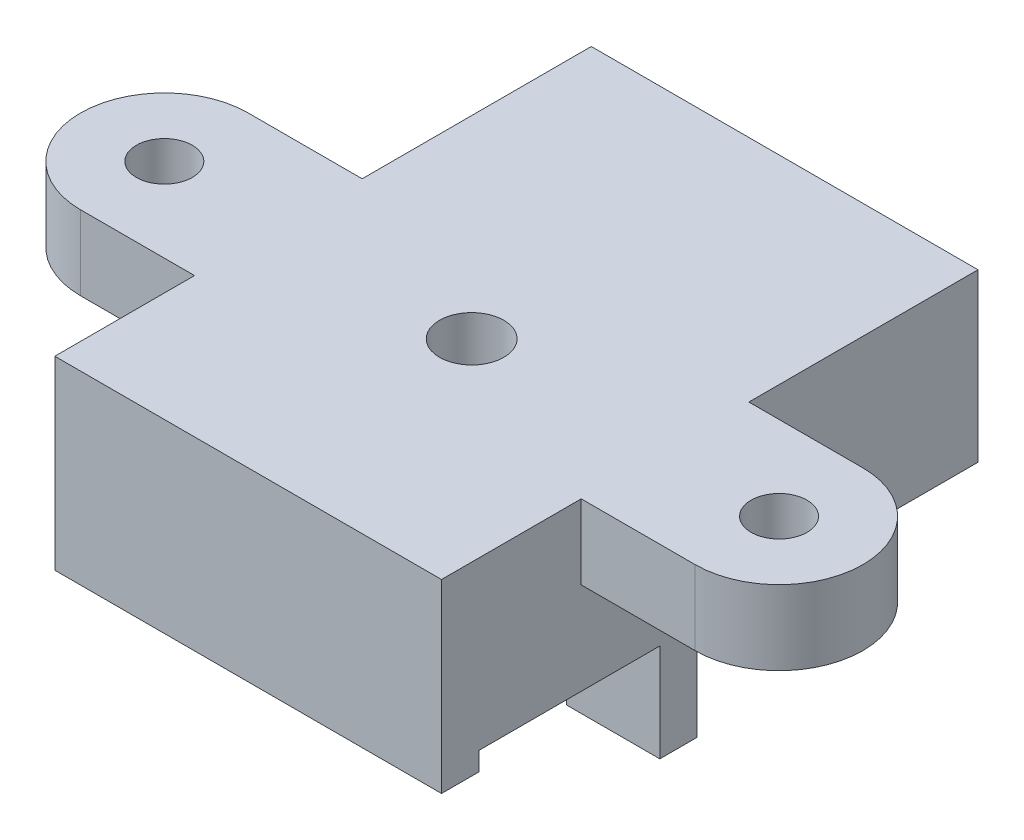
ISO-10303-21;
HEADER;
FILE_DESCRIPTION(('STEP AP214'),'2;1');
FILE_NAME('part.step','',(''),(''),'','','');
FILE_SCHEMA(('AUTOMOTIVE_DESIGN { 1 0 10303 214 1 1 1 1 }'));
ENDSEC;
DATA;
#1=APPLICATION_CONTEXT('core data for automotive mechanical design processes');
#2=APPLICATION_PROTOCOL_DEFINITION('international standard','automotive_design',2000,#1);
#3=PRODUCT_CONTEXT('',#1,'mechanical');
#4=PRODUCT('Part','Part','',(#3));
#5=PRODUCT_RELATED_PRODUCT_CATEGORY('part','',(#4));
#6=PRODUCT_DEFINITION_FORMATION('','',#4);
#7=PRODUCT_DEFINITION_CONTEXT('part definition',#1,'design');
#8=PRODUCT_DEFINITION('design','',#6,#7);
#9=PRODUCT_DEFINITION_SHAPE('','',#8);
#10=(LENGTH_UNIT() NAMED_UNIT(*) SI_UNIT(.MILLI.,.METRE.));
#11=(NAMED_UNIT(*) PLANE_ANGLE_UNIT() SI_UNIT($,.RADIAN.));
#12=(NAMED_UNIT(*) SI_UNIT($,.STERADIAN.) SOLID_ANGLE_UNIT());
#13=UNCERTAINTY_MEASURE_WITH_UNIT(LENGTH_MEASURE(1.E-05),#10,'distance_accuracy_value','');
#14=(GEOMETRIC_REPRESENTATION_CONTEXT(3) GLOBAL_UNCERTAINTY_ASSIGNED_CONTEXT((#13)) GLOBAL_UNIT_ASSIGNED_CONTEXT((#10,
#11,#12)) REPRESENTATION_CONTEXT('',''));
#15=CARTESIAN_POINT('',(0.,0.,0.));
#16=DIRECTION('',(0.,0.,1.));
#17=DIRECTION('',(1.,0.,0.));
#18=AXIS2_PLACEMENT_3D('',#15,#16,#17);
#19=CARTESIAN_POINT('',(74.13,-7.,-34.5));
#20=DIRECTION('',(0.,-1.,0.));
#21=DIRECTION('',(0.,0.,-1.));
#22=AXIS2_PLACEMENT_3D('',#19,#20,#21);
#23=PLANE('',#22);
#24=CARTESIAN_POINT('',(80.25,-7.,-39.));
#25=DIRECTION('',(0.,-1.,0.));
#26=DIRECTION('',(0.,0.,-1.));
#27=AXIS2_PLACEMENT_3D('',#24,#25,#26);
#28=CIRCLE('',#27,1.50000000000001);
#29=CARTESIAN_POINT('',(80.25,-7.,-40.5));
#30=VERTEX_POINT('',#29);
#31=EDGE_CURVE('E44',#30,#30,#28,.T.);
#32=ORIENTED_EDGE('',*,*,#31,.T.);
#33=EDGE_LOOP('',(#32));
#34=FACE_BOUND('',#33,.T.);
#35=DIRECTION('',(0.,0.,-1.));
#36=VECTOR('',#35,1.);
#37=CARTESIAN_POINT('',(53.37,-7.,0.));
#38=LINE('',#37,#36);
#39=CARTESIAN_POINT('',(53.37,-7.,-43.5));
#40=VERTEX_POINT('',#39);
#41=CARTESIAN_POINT('',(53.37,-7.,-55.8));
#42=VERTEX_POINT('',#41);
#43=EDGE_CURVE('E781',#40,#42,#38,.T.);
#44=ORIENTED_EDGE('',*,*,#43,.F.);
#45=DIRECTION('',(1.,0.,0.));
#46=VECTOR('',#45,1.);
#47=CARTESIAN_POINT('',(0.,-7.,-43.5));
#48=LINE('',#47,#46);
#49=CARTESIAN_POINT('',(47.25,-7.,-43.5));
#50=VERTEX_POINT('',#49);
#51=EDGE_CURVE('E783',#50,#40,#48,.T.);
#52=ORIENTED_EDGE('',*,*,#51,.F.);
#53=CARTESIAN_POINT('',(47.25,-7.,-39.));
#54=DIRECTION('',(0.,-1.,0.));
#55=DIRECTION('',(0.,0.,-1.));
#56=AXIS2_PLACEMENT_3D('',#53,#54,#55);
#57=CIRCLE('',#56,4.5);
#58=CARTESIAN_POINT('',(47.25,-7.,-34.5));
#59=VERTEX_POINT('',#58);
#60=EDGE_CURVE('E572',#59,#50,#57,.T.);
#61=ORIENTED_EDGE('',*,*,#60,.F.);
#62=DIRECTION('',(1.,0.,0.));
#63=VECTOR('',#62,1.);
#64=CARTESIAN_POINT('',(0.,-7.,-34.5));
#65=LINE('',#64,#63);
#66=CARTESIAN_POINT('',(53.37,-7.,-34.5));
#67=VERTEX_POINT('',#66);
#68=EDGE_CURVE('E562',#59,#67,#65,.T.);
#69=ORIENTED_EDGE('',*,*,#68,.T.);
#70=DIRECTION('',(0.,0.,1.));
#71=VECTOR('',#70,1.);
#72=CARTESIAN_POINT('',(53.37,-7.,0.));
#73=LINE('',#72,#71);
#74=CARTESIAN_POINT('',(53.37,-7.,-27.));
#75=VERTEX_POINT('',#74);
#76=EDGE_CURVE('E57',#67,#75,#73,.T.);
#77=ORIENTED_EDGE('',*,*,#76,.T.);
#78=DIRECTION('',(-1.,0.,0.));
#79=VECTOR('',#78,1.);
#80=CARTESIAN_POINT('',(0.,-7.,-27.));
#81=LINE('',#80,#79);
#82=CARTESIAN_POINT('',(74.13,-7.,-27.));
#83=VERTEX_POINT('',#82);
#84=EDGE_CURVE('E554',#83,#75,#81,.T.);
#85=ORIENTED_EDGE('',*,*,#84,.F.);
#86=DIRECTION('',(0.,0.,1.));
#87=VECTOR('',#86,1.);
#88=CARTESIAN_POINT('',(74.13,-7.,0.));
#89=LINE('',#88,#87);
#90=CARTESIAN_POINT('',(74.13,-7.,-34.5));
#91=VERTEX_POINT('',#90);
#92=EDGE_CURVE('E569',#91,#83,#89,.T.);
#93=ORIENTED_EDGE('',*,*,#92,.F.);
#94=DIRECTION('',(-1.,0.,0.));
#95=VECTOR('',#94,1.);
#96=CARTESIAN_POINT('',(0.,-7.,-34.5));
#97=LINE('',#96,#95);
#98=CARTESIAN_POINT('',(80.25,-7.,-34.5));
#99=VERTEX_POINT('',#98);
#100=EDGE_CURVE('E596',#99,#91,#97,.T.);
#101=ORIENTED_EDGE('',*,*,#100,.F.);
#102=CARTESIAN_POINT('',(80.25,-7.,-39.));
#103=DIRECTION('',(0.,-1.,0.));
#104=DIRECTION('',(0.,0.,-1.));
#105=AXIS2_PLACEMENT_3D('',#102,#103,#104);
#106=CIRCLE('',#105,4.49999999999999);
#107=CARTESIAN_POINT('',(80.25,-7.,-43.5));
#108=VERTEX_POINT('',#107);
#109=EDGE_CURVE('E777',#108,#99,#106,.T.);
#110=ORIENTED_EDGE('',*,*,#109,.F.);
#111=DIRECTION('',(-1.,0.,0.));
#112=VECTOR('',#111,1.);
#113=CARTESIAN_POINT('',(0.,-7.,-43.5));
#114=LINE('',#113,#112);
#115=CARTESIAN_POINT('',(74.13,-7.,-43.5));
#116=VERTEX_POINT('',#115);
#117=EDGE_CURVE('E11',#108,#116,#114,.T.);
#118=ORIENTED_EDGE('',*,*,#117,.T.);
#119=DIRECTION('',(0.,0.,-1.));
#120=VECTOR('',#119,1.);
#121=CARTESIAN_POINT('',(74.13,-7.,0.));
#122=LINE('',#121,#120);
#123=CARTESIAN_POINT('',(74.13,-7.,-55.8));
#124=VERTEX_POINT('',#123);
#125=EDGE_CURVE('E49',#116,#124,#122,.T.);
#126=ORIENTED_EDGE('',*,*,#125,.T.);
#127=DIRECTION('',(1.,0.,0.));
#128=VECTOR('',#127,1.);
#129=CARTESIAN_POINT('',(0.,-7.,-55.8));
#130=LINE('',#129,#128);
#131=EDGE_CURVE('E65',#42,#124,#130,.T.);
#132=ORIENTED_EDGE('',*,*,#131,.F.);
#133=EDGE_LOOP('',(#44,#52,#61,#69,#77,#85,#93,#101,#110,#118,#126,#132));
#134=FACE_BOUND('',#133,.T.);
#135=CARTESIAN_POINT('',(63.75,-7.,-39.));
#136=DIRECTION('',(0.,-1.,0.));
#137=DIRECTION('',(0.,0.,-1.));
#138=AXIS2_PLACEMENT_3D('',#135,#136,#137);
#139=CIRCLE('',#138,1.725);
#140=CARTESIAN_POINT('',(63.75,-7.,-40.725));
#141=VERTEX_POINT('',#140);
#142=EDGE_CURVE('E546',#141,#141,#139,.F.);
#143=ORIENTED_EDGE('',*,*,#142,.F.);
#144=EDGE_LOOP('',(#143));
#145=FACE_BOUND('',#144,.T.);
#146=CARTESIAN_POINT('',(47.25,-7.,-39.));
#147=DIRECTION('',(0.,-1.,0.));
#148=DIRECTION('',(0.,0.,-1.));
#149=AXIS2_PLACEMENT_3D('',#146,#147,#148);
#150=CIRCLE('',#149,1.5);
#151=CARTESIAN_POINT('',(47.25,-7.,-40.5));
#152=VERTEX_POINT('',#151);
#153=EDGE_CURVE('E555',#152,#152,#150,.F.);
#154=ORIENTED_EDGE('',*,*,#153,.F.);
#155=EDGE_LOOP('',(#154));
#156=FACE_BOUND('',#155,.T.);
#157=ADVANCED_FACE('F41',(#34,#134,#145,#156),#23,.F.);
#158=CARTESIAN_POINT('',(64.75,-50.85011209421,0.));
#159=DIRECTION('',(1.,0.,0.));
#160=DIRECTION('',(0.,0.,-1.));
#161=AXIS2_PLACEMENT_3D('',#158,#159,#160);
#162=PLANE('',#161);
#163=DIRECTION('',(0.,1.,0.));
#164=VECTOR('',#163,1.);
#165=CARTESIAN_POINT('',(64.75,-50.85011209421,-43.8989794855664));
#166=LINE('',#165,#164);
#167=CARTESIAN_POINT('',(64.75,-15.95,-43.8989794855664));
#168=VERTEX_POINT('',#167);
#169=CARTESIAN_POINT('',(64.75,-11.,-43.8989794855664));
#170=VERTEX_POINT('',#169);
#171=EDGE_CURVE('E383',#168,#170,#166,.T.);
#172=ORIENTED_EDGE('',*,*,#171,.F.);
#173=DIRECTION('',(0.,0.,-1.));
#174=VECTOR('',#173,1.);
#175=CARTESIAN_POINT('',(64.75,-15.95,0.));
#176=LINE('',#175,#174);
#177=CARTESIAN_POINT('',(64.75,-15.95,-52.8));
#178=VERTEX_POINT('',#177);
#179=EDGE_CURVE('E384',#168,#178,#176,.T.);
#180=ORIENTED_EDGE('',*,*,#179,.T.);
#181=DIRECTION('',(0.,1.,0.));
#182=VECTOR('',#181,1.);
#183=CARTESIAN_POINT('',(64.75,-50.85011209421,-52.8));
#184=LINE('',#183,#182);
#185=CARTESIAN_POINT('',(64.75,-11.,-52.8));
#186=VERTEX_POINT('',#185);
#187=EDGE_CURVE('E387',#178,#186,#184,.T.);
#188=ORIENTED_EDGE('',*,*,#187,.T.);
#189=DIRECTION('',(0.,0.,-1.));
#190=VECTOR('',#189,1.);
#191=CARTESIAN_POINT('',(64.75,-11.,0.));
#192=LINE('',#191,#190);
#193=EDGE_CURVE('E369',#170,#186,#192,.T.);
#194=ORIENTED_EDGE('',*,*,#193,.F.);
#195=EDGE_LOOP('',(#172,#180,#188,#194));
#196=FACE_BOUND('',#195,.T.);
#197=ADVANCED_FACE('F673',(#196),#162,.T.);
#198=CARTESIAN_POINT('',(0.,-15.95,0.));
#199=DIRECTION('',(0.,-1.,0.));
#200=DIRECTION('',(0.,0.,-1.));
#201=AXIS2_PLACEMENT_3D('',#198,#199,#200);
#202=PLANE('',#201);
#203=DIRECTION('',(0.,0.,-1.));
#204=VECTOR('',#203,1.);
#205=CARTESIAN_POINT('',(62.75,-15.95,0.));
#206=LINE('',#205,#204);
#207=CARTESIAN_POINT('',(62.75,-15.95,-43.8989794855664));
#208=VERTEX_POINT('',#207);
#209=CARTESIAN_POINT('',(62.75,-15.95,-52.8));
#210=VERTEX_POINT('',#209);
#211=EDGE_CURVE('E368',#208,#210,#206,.T.);
#212=ORIENTED_EDGE('',*,*,#211,.T.);
#213=DIRECTION('',(1.,0.,0.));
#214=VECTOR('',#213,1.);
#215=CARTESIAN_POINT('',(0.,-15.95,-52.8));
#216=LINE('',#215,#214);
#217=EDGE_CURVE('E454',#210,#178,#216,.T.);
#218=ORIENTED_EDGE('',*,*,#217,.T.);
#219=ORIENTED_EDGE('',*,*,#179,.F.);
#220=CARTESIAN_POINT('',(63.75,-15.95,-39.));
#221=DIRECTION('',(0.,-1.,0.));
#222=DIRECTION('',(0.,0.,-1.));
#223=AXIS2_PLACEMENT_3D('',#220,#221,#222);
#224=CIRCLE('',#223,5.00000000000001);
#225=EDGE_CURVE('E379',#208,#168,#224,.T.);
#226=ORIENTED_EDGE('',*,*,#225,.F.);
#227=EDGE_LOOP('',(#212,#218,#219,#226));
#228=FACE_BOUND('',#227,.T.);
#229=ADVANCED_FACE('F680',(#228),#202,.T.);
#230=CARTESIAN_POINT('',(62.75,-50.85011209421,0.));
#231=DIRECTION('',(1.,0.,0.));
#232=DIRECTION('',(0.,0.,-1.));
#233=AXIS2_PLACEMENT_3D('',#230,#231,#232);
#234=PLANE('',#233);
#235=ORIENTED_EDGE('',*,*,#211,.F.);
#236=DIRECTION('',(0.,1.,0.));
#237=VECTOR('',#236,1.);
#238=CARTESIAN_POINT('',(62.75,-50.85011209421,-43.8989794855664));
#239=LINE('',#238,#237);
#240=CARTESIAN_POINT('',(62.75,-11.,-43.8989794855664));
#241=VERTEX_POINT('',#240);
#242=EDGE_CURVE('E426',#208,#241,#239,.T.);
#243=ORIENTED_EDGE('',*,*,#242,.T.);
#244=DIRECTION('',(0.,0.,-1.));
#245=VECTOR('',#244,1.);
#246=CARTESIAN_POINT('',(62.75,-11.,0.));
#247=LINE('',#246,#245);
#248=CARTESIAN_POINT('',(62.75,-11.,-52.8));
#249=VERTEX_POINT('',#248);
#250=EDGE_CURVE('E382',#241,#249,#247,.T.);
#251=ORIENTED_EDGE('',*,*,#250,.T.);
#252=DIRECTION('',(0.,1.,0.));
#253=VECTOR('',#252,1.);
#254=CARTESIAN_POINT('',(62.75,-50.85011209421,-52.8));
#255=LINE('',#254,#253);
#256=EDGE_CURVE('E376',#210,#249,#255,.T.);
#257=ORIENTED_EDGE('',*,*,#256,.F.);
#258=EDGE_LOOP('',(#235,#243,#251,#257));
#259=FACE_BOUND('',#258,.T.);
#260=ADVANCED_FACE('F683',(#259),#234,.F.);
#261=CARTESIAN_POINT('',(0.,-11.,0.));
#262=DIRECTION('',(0.,-1.,0.));
#263=DIRECTION('',(0.,0.,-1.));
#264=AXIS2_PLACEMENT_3D('',#261,#262,#263);
#265=PLANE('',#264);
#266=DIRECTION('',(0.,0.,-1.));
#267=VECTOR('',#266,1.);
#268=CARTESIAN_POINT('',(71.13,-11.,0.));
#269=LINE('',#268,#267);
#270=CARTESIAN_POINT('',(71.13,-11.,-40.72));
#271=VERTEX_POINT('',#270);
#272=CARTESIAN_POINT('',(71.13,-11.,-52.8));
#273=VERTEX_POINT('',#272);
#274=EDGE_CURVE('E419',#271,#273,#269,.T.);
#275=ORIENTED_EDGE('',*,*,#274,.F.);
#276=DIRECTION('',(1.,0.,0.));
#277=VECTOR('',#276,1.);
#278=CARTESIAN_POINT('',(0.,-11.,-40.72));
#279=LINE('',#278,#277);
#280=CARTESIAN_POINT('',(68.4448482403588,-11.,-40.72));
#281=VERTEX_POINT('',#280);
#282=EDGE_CURVE('E619',#281,#271,#279,.T.);
#283=ORIENTED_EDGE('',*,*,#282,.F.);
#284=CARTESIAN_POINT('',(63.75,-11.,-39.));
#285=DIRECTION('',(0.,-1.,0.));
#286=DIRECTION('',(0.,0.,-1.));
#287=AXIS2_PLACEMENT_3D('',#284,#285,#286);
#288=CIRCLE('',#287,5.00000000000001);
#289=EDGE_CURVE('E415',#170,#281,#288,.T.);
#290=ORIENTED_EDGE('',*,*,#289,.F.);
#291=ORIENTED_EDGE('',*,*,#193,.T.);
#292=DIRECTION('',(-1.,0.,0.));
#293=VECTOR('',#292,1.);
#294=CARTESIAN_POINT('',(0.,-11.,-52.8));
#295=LINE('',#294,#293);
#296=EDGE_CURVE('E420',#273,#186,#295,.T.);
#297=ORIENTED_EDGE('',*,*,#296,.F.);
#298=EDGE_LOOP('',(#275,#283,#290,#291,#297));
#299=FACE_BOUND('',#298,.T.);
#300=ADVANCED_FACE('F668',(#299),#265,.T.);
#301=CARTESIAN_POINT('',(71.13,-50.85011209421,0.));
#302=DIRECTION('',(1.,0.,0.));
#303=DIRECTION('',(0.,0.,-1.));
#304=AXIS2_PLACEMENT_3D('',#301,#302,#303);
#305=PLANE('',#304);
#306=DIRECTION('',(0.,-1.,0.));
#307=VECTOR('',#306,1.);
#308=CARTESIAN_POINT('',(71.13,-50.85011209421,-40.72));
#309=LINE('',#308,#307);
#310=CARTESIAN_POINT('',(71.13,-15.95,-40.72));
#311=VERTEX_POINT('',#310);
#312=EDGE_CURVE('E358',#271,#311,#309,.T.);
#313=ORIENTED_EDGE('',*,*,#312,.F.);
#314=ORIENTED_EDGE('',*,*,#274,.T.);
#315=DIRECTION('',(0.,1.,0.));
#316=VECTOR('',#315,1.);
#317=CARTESIAN_POINT('',(71.13,-50.85011209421,-52.8));
#318=LINE('',#317,#316);
#319=CARTESIAN_POINT('',(71.13,-15.95,-52.8));
#320=VERTEX_POINT('',#319);
#321=EDGE_CURVE('E422',#320,#273,#318,.T.);
#322=ORIENTED_EDGE('',*,*,#321,.F.);
#323=DIRECTION('',(0.,0.,-1.));
#324=VECTOR('',#323,1.);
#325=CARTESIAN_POINT('',(71.13,-15.95,0.));
#326=LINE('',#325,#324);
#327=EDGE_CURVE('E392',#311,#320,#326,.T.);
#328=ORIENTED_EDGE('',*,*,#327,.F.);
#329=EDGE_LOOP('',(#313,#314,#322,#328));
#330=FACE_BOUND('',#329,.T.);
#331=ADVANCED_FACE('F885',(#330),#305,.F.);
#332=CARTESIAN_POINT('',(71.13,-11.,-29.));
#333=VERTEX_POINT('',#332);
#334=CARTESIAN_POINT('',(71.13,-11.,-38.72));
#335=VERTEX_POINT('',#334);
#336=EDGE_CURVE('E396',#333,#335,#269,.T.);
#337=ORIENTED_EDGE('',*,*,#336,.T.);
#338=DIRECTION('',(0.,-1.,0.));
#339=VECTOR('',#338,1.);
#340=CARTESIAN_POINT('',(71.13,-50.85011209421,-38.72));
#341=LINE('',#340,#339);
#342=CARTESIAN_POINT('',(71.13,-15.95,-38.72));
#343=VERTEX_POINT('',#342);
#344=EDGE_CURVE('E739',#335,#343,#341,.T.);
#345=ORIENTED_EDGE('',*,*,#344,.T.);
#346=CARTESIAN_POINT('',(71.13,-15.95,-29.));
#347=VERTEX_POINT('',#346);
#348=EDGE_CURVE('E389',#347,#343,#326,.T.);
#349=ORIENTED_EDGE('',*,*,#348,.F.);
#350=DIRECTION('',(0.,1.,0.));
#351=VECTOR('',#350,1.);
#352=CARTESIAN_POINT('',(71.13,-50.85011209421,-29.));
#353=LINE('',#352,#351);
#354=EDGE_CURVE('E373',#347,#333,#353,.T.);
#355=ORIENTED_EDGE('',*,*,#354,.T.);
#356=EDGE_LOOP('',(#337,#345,#349,#355));
#357=FACE_BOUND('',#356,.T.);
#358=ADVANCED_FACE('F882',(#357),#305,.F.);
#359=CARTESIAN_POINT('',(56.37,-50.85011209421,0.));
#360=DIRECTION('',(-1.,0.,0.));
#361=DIRECTION('',(0.,0.,1.));
#362=AXIS2_PLACEMENT_3D('',#359,#360,#361);
#363=PLANE('',#362);
#364=DIRECTION('',(0.,-1.,0.));
#365=VECTOR('',#364,1.);
#366=CARTESIAN_POINT('',(56.37,-50.85011209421,-37.28));
#367=LINE('',#366,#365);
#368=CARTESIAN_POINT('',(56.37,-11.,-37.28));
#369=VERTEX_POINT('',#368);
#370=CARTESIAN_POINT('',(56.37,-15.95,-37.28));
#371=VERTEX_POINT('',#370);
#372=EDGE_CURVE('E359',#369,#371,#367,.T.);
#373=ORIENTED_EDGE('',*,*,#372,.F.);
#374=DIRECTION('',(0.,0.,1.));
#375=VECTOR('',#374,1.);
#376=CARTESIAN_POINT('',(56.37,-11.,0.));
#377=LINE('',#376,#375);
#378=CARTESIAN_POINT('',(56.37,-11.,-29.));
#379=VERTEX_POINT('',#378);
#380=EDGE_CURVE('E429',#369,#379,#377,.T.);
#381=ORIENTED_EDGE('',*,*,#380,.T.);
#382=DIRECTION('',(0.,1.,0.));
#383=VECTOR('',#382,1.);
#384=CARTESIAN_POINT('',(56.37,-50.85011209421,-29.));
#385=LINE('',#384,#383);
#386=CARTESIAN_POINT('',(56.37,-15.95,-29.));
#387=VERTEX_POINT('',#386);
#388=EDGE_CURVE('E412',#387,#379,#385,.T.);
#389=ORIENTED_EDGE('',*,*,#388,.F.);
#390=DIRECTION('',(0.,0.,1.));
#391=VECTOR('',#390,1.);
#392=CARTESIAN_POINT('',(56.37,-15.95,0.));
#393=LINE('',#392,#391);
#394=EDGE_CURVE('E365',#371,#387,#393,.T.);
#395=ORIENTED_EDGE('',*,*,#394,.F.);
#396=EDGE_LOOP('',(#373,#381,#389,#395));
#397=FACE_BOUND('',#396,.T.);
#398=ADVANCED_FACE('F884',(#397),#363,.F.);
#399=ORIENTED_EDGE('',*,*,#380,.F.);
#400=DIRECTION('',(-1.,0.,0.));
#401=VECTOR('',#400,1.);
#402=CARTESIAN_POINT('',(0.,-11.,-37.28));
#403=LINE('',#402,#401);
#404=CARTESIAN_POINT('',(59.0551517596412,-11.,-37.28));
#405=VERTEX_POINT('',#404);
#406=EDGE_CURVE('E611',#405,#369,#403,.T.);
#407=ORIENTED_EDGE('',*,*,#406,.F.);
#408=CARTESIAN_POINT('',(63.75,-11.,-39.));
#409=DIRECTION('',(0.,-1.,0.));
#410=DIRECTION('',(0.,0.,-1.));
#411=AXIS2_PLACEMENT_3D('',#408,#409,#410);
#412=CIRCLE('',#411,5.00000000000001);
#413=CARTESIAN_POINT('',(68.7421538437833,-11.,-38.72));
#414=VERTEX_POINT('',#413);
#415=EDGE_CURVE('E614',#414,#405,#412,.T.);
#416=ORIENTED_EDGE('',*,*,#415,.F.);
#417=DIRECTION('',(1.,0.,0.));
#418=VECTOR('',#417,1.);
#419=CARTESIAN_POINT('',(0.,-11.,-38.72));
#420=LINE('',#419,#418);
#421=EDGE_CURVE('E617',#414,#335,#420,.T.);
#422=ORIENTED_EDGE('',*,*,#421,.T.);
#423=ORIENTED_EDGE('',*,*,#336,.F.);
#424=DIRECTION('',(1.,0.,0.));
#425=VECTOR('',#424,1.);
#426=CARTESIAN_POINT('',(0.,-11.,-29.));
#427=LINE('',#426,#425);
#428=EDGE_CURVE('E433',#379,#333,#427,.T.);
#429=ORIENTED_EDGE('',*,*,#428,.F.);
#430=EDGE_LOOP('',(#399,#407,#416,#422,#423,#429));
#431=FACE_BOUND('',#430,.T.);
#432=ADVANCED_FACE('F913',(#431),#265,.T.);
#433=DIRECTION('',(-1.,0.,0.));
#434=VECTOR('',#433,1.);
#435=CARTESIAN_POINT('',(0.,-11.,-39.28));
#436=LINE('',#435,#434);
#437=CARTESIAN_POINT('',(58.7578461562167,-11.,-39.28));
#438=VERTEX_POINT('',#437);
#439=CARTESIAN_POINT('',(56.37,-11.,-39.28));
#440=VERTEX_POINT('',#439);
#441=EDGE_CURVE('E609',#438,#440,#436,.T.);
#442=ORIENTED_EDGE('',*,*,#441,.T.);
#443=CARTESIAN_POINT('',(56.37,-11.,-52.8));
#444=VERTEX_POINT('',#443);
#445=EDGE_CURVE('E357',#444,#440,#377,.T.);
#446=ORIENTED_EDGE('',*,*,#445,.F.);
#447=DIRECTION('',(1.,0.,0.));
#448=VECTOR('',#447,1.);
#449=CARTESIAN_POINT('',(0.,-11.,-52.8));
#450=LINE('',#449,#448);
#451=EDGE_CURVE('E366',#444,#249,#450,.T.);
#452=ORIENTED_EDGE('',*,*,#451,.T.);
#453=ORIENTED_EDGE('',*,*,#250,.F.);
#454=EDGE_CURVE('E621',#438,#241,#288,.T.);
#455=ORIENTED_EDGE('',*,*,#454,.F.);
#456=EDGE_LOOP('',(#442,#446,#452,#453,#455));
#457=FACE_BOUND('',#456,.T.);
#458=ADVANCED_FACE('F688',(#457),#265,.T.);
#459=ORIENTED_EDGE('',*,*,#445,.T.);
#460=DIRECTION('',(0.,-1.,0.));
#461=VECTOR('',#460,1.);
#462=CARTESIAN_POINT('',(56.37,-50.85011209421,-39.28));
#463=LINE('',#462,#461);
#464=CARTESIAN_POINT('',(56.37,-15.95,-39.28));
#465=VERTEX_POINT('',#464);
#466=EDGE_CURVE('E342',#440,#465,#463,.T.);
#467=ORIENTED_EDGE('',*,*,#466,.T.);
#468=CARTESIAN_POINT('',(56.37,-15.95,-52.8));
#469=VERTEX_POINT('',#468);
#470=EDGE_CURVE('E355',#469,#465,#393,.T.);
#471=ORIENTED_EDGE('',*,*,#470,.F.);
#472=DIRECTION('',(0.,1.,0.));
#473=VECTOR('',#472,1.);
#474=CARTESIAN_POINT('',(56.37,-50.85011209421,-52.8));
#475=LINE('',#474,#473);
#476=EDGE_CURVE('E649',#469,#444,#475,.T.);
#477=ORIENTED_EDGE('',*,*,#476,.T.);
#478=EDGE_LOOP('',(#459,#467,#471,#477));
#479=FACE_BOUND('',#478,.T.);
#480=ADVANCED_FACE('F354',(#479),#363,.F.);
#481=CARTESIAN_POINT('',(0.,-50.85011209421,-52.8));
#482=DIRECTION('',(0.,0.,1.));
#483=DIRECTION('',(1.,0.,0.));
#484=AXIS2_PLACEMENT_3D('',#481,#482,#483);
#485=PLANE('',#484);
#486=ORIENTED_EDGE('',*,*,#187,.F.);
#487=ORIENTED_EDGE('',*,*,#217,.F.);
#488=ORIENTED_EDGE('',*,*,#256,.T.);
#489=ORIENTED_EDGE('',*,*,#451,.F.);
#490=ORIENTED_EDGE('',*,*,#476,.F.);
#491=DIRECTION('',(1.,0.,0.));
#492=VECTOR('',#491,1.);
#493=CARTESIAN_POINT('',(0.,-15.95,-52.8));
#494=LINE('',#493,#492);
#495=CARTESIAN_POINT('',(58.25,-15.95,-52.8));
#496=VERTEX_POINT('',#495);
#497=EDGE_CURVE('E363',#469,#496,#494,.T.);
#498=ORIENTED_EDGE('',*,*,#497,.T.);
#499=DIRECTION('',(0.,1.,0.));
#500=VECTOR('',#499,1.);
#501=CARTESIAN_POINT('',(58.25,-37.8061166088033,-52.8));
#502=LINE('',#501,#500);
#503=CARTESIAN_POINT('',(58.25,-16.95,-52.8));
#504=VERTEX_POINT('',#503);
#505=EDGE_CURVE('E468',#504,#496,#502,.T.);
#506=ORIENTED_EDGE('',*,*,#505,.F.);
#507=DIRECTION('',(-1.,0.,0.));
#508=VECTOR('',#507,1.);
#509=CARTESIAN_POINT('',(0.,-16.95,-52.8));
#510=LINE('',#509,#508);
#511=CARTESIAN_POINT('',(62.75,-16.95,-52.8));
#512=VERTEX_POINT('',#511);
#513=EDGE_CURVE('E480',#512,#504,#510,.T.);
#514=ORIENTED_EDGE('',*,*,#513,.F.);
#515=DIRECTION('',(0.,1.,0.));
#516=VECTOR('',#515,1.);
#517=CARTESIAN_POINT('',(62.75,-26.555551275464,-52.8));
#518=LINE('',#517,#516);
#519=CARTESIAN_POINT('',(62.75,-19.95,-52.8));
#520=VERTEX_POINT('',#519);
#521=EDGE_CURVE('E494',#520,#512,#518,.T.);
#522=ORIENTED_EDGE('',*,*,#521,.F.);
#523=DIRECTION('',(1.,0.,0.));
#524=VECTOR('',#523,1.);
#525=CARTESIAN_POINT('',(0.,-19.95,-52.8));
#526=LINE('',#525,#524);
#527=CARTESIAN_POINT('',(64.75,-19.95,-52.8));
#528=VERTEX_POINT('',#527);
#529=EDGE_CURVE('E486',#520,#528,#526,.T.);
#530=ORIENTED_EDGE('',*,*,#529,.T.);
#531=DIRECTION('',(0.,1.,0.));
#532=VECTOR('',#531,1.);
#533=CARTESIAN_POINT('',(64.75,-26.555551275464,-52.8));
#534=LINE('',#533,#532);
#535=CARTESIAN_POINT('',(64.75,-16.95,-52.8));
#536=VERTEX_POINT('',#535);
#537=EDGE_CURVE('E463',#528,#536,#534,.T.);
#538=ORIENTED_EDGE('',*,*,#537,.T.);
#539=CARTESIAN_POINT('',(69.25,-16.95,-52.8));
#540=VERTEX_POINT('',#539);
#541=EDGE_CURVE('E459',#540,#536,#510,.T.);
#542=ORIENTED_EDGE('',*,*,#541,.F.);
#543=DIRECTION('',(0.,1.,0.));
#544=VECTOR('',#543,1.);
#545=CARTESIAN_POINT('',(69.25,-37.8061166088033,-52.8));
#546=LINE('',#545,#544);
#547=CARTESIAN_POINT('',(69.25,-15.95,-52.8));
#548=VERTEX_POINT('',#547);
#549=EDGE_CURVE('E464',#540,#548,#546,.T.);
#550=ORIENTED_EDGE('',*,*,#549,.T.);
#551=DIRECTION('',(-1.,0.,0.));
#552=VECTOR('',#551,1.);
#553=CARTESIAN_POINT('',(0.,-15.95,-52.8));
#554=LINE('',#553,#552);
#555=EDGE_CURVE('E378',#320,#548,#554,.T.);
#556=ORIENTED_EDGE('',*,*,#555,.F.);
#557=ORIENTED_EDGE('',*,*,#321,.T.);
#558=ORIENTED_EDGE('',*,*,#296,.T.);
#559=EDGE_LOOP('',(#486,#487,#488,#489,#490,#498,#506,#514,#522,#530,#538,#542,#550,#556,#557,#558));
#560=FACE_BOUND('',#559,.T.);
#561=ADVANCED_FACE('F663',(#560),#485,.T.);
#562=CARTESIAN_POINT('',(58.37,-30.8351648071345,0.));
#563=DIRECTION('',(1.,0.,0.));
#564=DIRECTION('',(0.,0.,-1.));
#565=AXIS2_PLACEMENT_3D('',#562,#563,#564);
#566=PLANE('',#565);
#567=DIRECTION('',(0.,1.,0.));
#568=VECTOR('',#567,1.);
#569=CARTESIAN_POINT('',(58.37,-30.8351648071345,-39.28));
#570=LINE('',#569,#568);
#571=CARTESIAN_POINT('',(58.37,-21.2,-39.28));
#572=VERTEX_POINT('',#571);
#573=CARTESIAN_POINT('',(58.37,-16.95,-39.28));
#574=VERTEX_POINT('',#573);
#575=EDGE_CURVE('E542',#572,#574,#570,.T.);
#576=ORIENTED_EDGE('',*,*,#575,.T.);
#577=DIRECTION('',(0.,0.,-1.));
#578=VECTOR('',#577,1.);
#579=CARTESIAN_POINT('',(58.37,-16.95,0.));
#580=LINE('',#579,#578);
#581=CARTESIAN_POINT('',(58.37,-16.95,-37.28));
#582=VERTEX_POINT('',#581);
#583=EDGE_CURVE('E629',#582,#574,#580,.T.);
#584=ORIENTED_EDGE('',*,*,#583,.F.);
#585=DIRECTION('',(0.,1.,0.));
#586=VECTOR('',#585,1.);
#587=CARTESIAN_POINT('',(58.37,-30.8351648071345,-37.28));
#588=LINE('',#587,#586);
#589=CARTESIAN_POINT('',(58.37,-21.2,-37.28));
#590=VERTEX_POINT('',#589);
#591=EDGE_CURVE('E538',#590,#582,#588,.T.);
#592=ORIENTED_EDGE('',*,*,#591,.F.);
#593=DIRECTION('',(0.,0.,-1.));
#594=VECTOR('',#593,1.);
#595=CARTESIAN_POINT('',(58.37,-21.2,0.));
#596=LINE('',#595,#594);
#597=EDGE_CURVE('E541',#590,#572,#596,.T.);
#598=ORIENTED_EDGE('',*,*,#597,.T.);
#599=EDGE_LOOP('',(#576,#584,#592,#598));
#600=FACE_BOUND('',#599,.T.);
#601=ADVANCED_FACE('F698',(#600),#566,.T.);
#602=CARTESIAN_POINT('',(63.75,-16.95,-39.));
#603=DIRECTION('',(0.,1.,0.));
#604=DIRECTION('',(0.,0.,1.));
#605=AXIS2_PLACEMENT_3D('',#602,#603,#604);
#606=CYLINDRICAL_SURFACE('',#605,5.00000000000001);
#607=ORIENTED_EDGE('',*,*,#415,.T.);
#608=DIRECTION('',(0.,1.,0.));
#609=VECTOR('',#608,1.);
#610=CARTESIAN_POINT('',(59.0551517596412,-16.95,-37.28));
#611=LINE('',#610,#609);
#612=CARTESIAN_POINT('',(59.0551517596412,-16.95,-37.28));
#613=VERTEX_POINT('',#612);
#614=EDGE_CURVE('E602',#613,#405,#611,.T.);
#615=ORIENTED_EDGE('',*,*,#614,.F.);
#616=CARTESIAN_POINT('',(63.75,-16.95,-39.));
#617=DIRECTION('',(0.,-1.,0.));
#618=DIRECTION('',(0.,0.,-1.));
#619=AXIS2_PLACEMENT_3D('',#616,#617,#618);
#620=CIRCLE('',#619,5.00000000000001);
#621=CARTESIAN_POINT('',(68.7421538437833,-16.95,-38.72));
#622=VERTEX_POINT('',#621);
#623=EDGE_CURVE('E635',#622,#613,#620,.T.);
#624=ORIENTED_EDGE('',*,*,#623,.F.);
#625=DIRECTION('',(0.,1.,0.));
#626=VECTOR('',#625,1.);
#627=CARTESIAN_POINT('',(68.7421538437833,-16.95,-38.72));
#628=LINE('',#627,#626);
#629=EDGE_CURVE('E599',#622,#414,#628,.T.);
#630=ORIENTED_EDGE('',*,*,#629,.T.);
#631=EDGE_LOOP('',(#607,#615,#624,#630));
#632=FACE_BOUND('',#631,.T.);
#633=ADVANCED_FACE('F842',(#632),#606,.T.);
#634=CARTESIAN_POINT('',(69.13,-30.8351648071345,0.));
#635=DIRECTION('',(1.,0.,0.));
#636=DIRECTION('',(0.,0.,-1.));
#637=AXIS2_PLACEMENT_3D('',#634,#635,#636);
#638=PLANE('',#637);
#639=DIRECTION('',(0.,0.,-1.));
#640=VECTOR('',#639,1.);
#641=CARTESIAN_POINT('',(69.13,-16.95,0.));
#642=LINE('',#641,#640);
#643=CARTESIAN_POINT('',(69.13,-16.95,-38.72));
#644=VERTEX_POINT('',#643);
#645=CARTESIAN_POINT('',(69.13,-16.95,-40.72));
#646=VERTEX_POINT('',#645);
#647=EDGE_CURVE('E640',#644,#646,#642,.T.);
#648=ORIENTED_EDGE('',*,*,#647,.T.);
#649=DIRECTION('',(0.,1.,0.));
#650=VECTOR('',#649,1.);
#651=CARTESIAN_POINT('',(69.13,-30.8351648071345,-40.72));
#652=LINE('',#651,#650);
#653=CARTESIAN_POINT('',(69.13,-21.2,-40.72));
#654=VERTEX_POINT('',#653);
#655=EDGE_CURVE('E511',#654,#646,#652,.T.);
#656=ORIENTED_EDGE('',*,*,#655,.F.);
#657=DIRECTION('',(0.,0.,-1.));
#658=VECTOR('',#657,1.);
#659=CARTESIAN_POINT('',(69.13,-21.2,0.));
#660=LINE('',#659,#658);
#661=CARTESIAN_POINT('',(69.13,-21.2,-38.72));
#662=VERTEX_POINT('',#661);
#663=EDGE_CURVE('E518',#662,#654,#660,.T.);
#664=ORIENTED_EDGE('',*,*,#663,.F.);
#665=DIRECTION('',(0.,1.,0.));
#666=VECTOR('',#665,1.);
#667=CARTESIAN_POINT('',(69.13,-30.8351648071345,-38.72));
#668=LINE('',#667,#666);
#669=EDGE_CURVE('E515',#662,#644,#668,.T.);
#670=ORIENTED_EDGE('',*,*,#669,.T.);
#671=EDGE_LOOP('',(#648,#656,#664,#670));
#672=FACE_BOUND('',#671,.T.);
#673=ADVANCED_FACE('F845',(#672),#638,.F.);
#674=CARTESIAN_POINT('',(80.25,-11.,-39.));
#675=DIRECTION('',(0.,1.,0.));
#676=DIRECTION('',(0.,0.,1.));
#677=AXIS2_PLACEMENT_3D('',#674,#675,#676);
#678=CYLINDRICAL_SURFACE('',#677,4.49999999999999);
#679=ORIENTED_EDGE('',*,*,#109,.T.);
#680=DIRECTION('',(0.,1.,0.));
#681=VECTOR('',#680,1.);
#682=CARTESIAN_POINT('',(80.25,-11.,-34.5));
#683=LINE('',#682,#681);
#684=CARTESIAN_POINT('',(80.25,-11.,-34.5));
#685=VERTEX_POINT('',#684);
#686=EDGE_CURVE('E771',#685,#99,#683,.T.);
#687=ORIENTED_EDGE('',*,*,#686,.F.);
#688=CARTESIAN_POINT('',(80.25,-11.,-39.));
#689=DIRECTION('',(0.,-1.,0.));
#690=DIRECTION('',(0.,0.,-1.));
#691=AXIS2_PLACEMENT_3D('',#688,#689,#690);
#692=CIRCLE('',#691,4.49999999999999);
#693=CARTESIAN_POINT('',(80.25,-11.,-43.5));
#694=VERTEX_POINT('',#693);
#695=EDGE_CURVE('E583',#694,#685,#692,.T.);
#696=ORIENTED_EDGE('',*,*,#695,.F.);
#697=DIRECTION('',(0.,1.,0.));
#698=VECTOR('',#697,1.);
#699=CARTESIAN_POINT('',(80.25,-11.,-43.5));
#700=LINE('',#699,#698);
#701=EDGE_CURVE('E768',#694,#108,#700,.T.);
#702=ORIENTED_EDGE('',*,*,#701,.T.);
#703=EDGE_LOOP('',(#679,#687,#696,#702));
#704=FACE_BOUND('',#703,.T.);
#705=ADVANCED_FACE('F848',(#704),#678,.T.);
#706=CARTESIAN_POINT('',(0.,-11.,-34.5));
#707=DIRECTION('',(0.,0.,-1.));
#708=DIRECTION('',(-1.,0.,0.));
#709=AXIS2_PLACEMENT_3D('',#706,#707,#708);
#710=PLANE('',#709);
#711=ORIENTED_EDGE('',*,*,#100,.T.);
#712=DIRECTION('',(0.,1.,0.));
#713=VECTOR('',#712,1.);
#714=CARTESIAN_POINT('',(74.13,-11.,-34.5));
#715=LINE('',#714,#713);
#716=CARTESIAN_POINT('',(74.13,-11.,-34.5));
#717=VERTEX_POINT('',#716);
#718=EDGE_CURVE('E577',#717,#91,#715,.T.);
#719=ORIENTED_EDGE('',*,*,#718,.F.);
#720=DIRECTION('',(-1.,0.,0.));
#721=VECTOR('',#720,1.);
#722=CARTESIAN_POINT('',(0.,-11.,-34.5));
#723=LINE('',#722,#721);
#724=EDGE_CURVE('E580',#685,#717,#723,.T.);
#725=ORIENTED_EDGE('',*,*,#724,.F.);
#726=ORIENTED_EDGE('',*,*,#686,.T.);
#727=EDGE_LOOP('',(#711,#719,#725,#726));
#728=FACE_BOUND('',#727,.T.);
#729=ADVANCED_FACE('F914',(#728),#710,.F.);
#730=CARTESIAN_POINT('',(80.25,-11.,-39.));
#731=DIRECTION('',(0.,-1.,0.));
#732=DIRECTION('',(0.,0.,-1.));
#733=AXIS2_PLACEMENT_3D('',#730,#731,#732);
#734=CIRCLE('',#733,1.50000000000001);
#735=CARTESIAN_POINT('',(80.25,-11.,-40.5));
#736=VERTEX_POINT('',#735);
#737=EDGE_CURVE('E573',#736,#736,#734,.F.);
#738=ORIENTED_EDGE('',*,*,#737,.T.);
#739=EDGE_LOOP('',(#738));
#740=FACE_BOUND('',#739,.T.);
#741=ORIENTED_EDGE('',*,*,#724,.T.);
#742=DIRECTION('',(0.,0.,1.));
#743=VECTOR('',#742,1.);
#744=CARTESIAN_POINT('',(74.13,-11.,0.));
#745=LINE('',#744,#743);
#746=CARTESIAN_POINT('',(74.13,-11.,-43.5));
#747=VERTEX_POINT('',#746);
#748=EDGE_CURVE('E397',#747,#717,#745,.T.);
#749=ORIENTED_EDGE('',*,*,#748,.F.);
#750=DIRECTION('',(-1.,0.,0.));
#751=VECTOR('',#750,1.);
#752=CARTESIAN_POINT('',(0.,-11.,-43.5));
#753=LINE('',#752,#751);
#754=EDGE_CURVE('E585',#694,#747,#753,.T.);
#755=ORIENTED_EDGE('',*,*,#754,.F.);
#756=ORIENTED_EDGE('',*,*,#695,.T.);
#757=EDGE_LOOP('',(#741,#749,#755,#756));
#758=FACE_BOUND('',#757,.T.);
#759=ADVANCED_FACE('F814',(#740,#758),#265,.T.);
#760=CARTESIAN_POINT('',(0.,-11.,-43.5));
#761=DIRECTION('',(0.,0.,-1.));
#762=DIRECTION('',(-1.,0.,0.));
#763=AXIS2_PLACEMENT_3D('',#760,#761,#762);
#764=PLANE('',#763);
#765=ORIENTED_EDGE('',*,*,#117,.F.);
#766=ORIENTED_EDGE('',*,*,#701,.F.);
#767=ORIENTED_EDGE('',*,*,#754,.T.);
#768=DIRECTION('',(0.,1.,0.));
#769=VECTOR('',#768,1.);
#770=CARTESIAN_POINT('',(74.13,-11.,-43.5));
#771=LINE('',#770,#769);
#772=EDGE_CURVE('E765',#747,#116,#771,.T.);
#773=ORIENTED_EDGE('',*,*,#772,.T.);
#774=EDGE_LOOP('',(#765,#766,#767,#773));
#775=FACE_BOUND('',#774,.T.);
#776=ADVANCED_FACE('F908',(#775),#764,.T.);
#777=CARTESIAN_POINT('',(0.,-16.95,-40.72));
#778=DIRECTION('',(0.,0.,1.));
#779=DIRECTION('',(1.,0.,0.));
#780=AXIS2_PLACEMENT_3D('',#777,#778,#779);
#781=PLANE('',#780);
#782=ORIENTED_EDGE('',*,*,#282,.T.);
#783=ORIENTED_EDGE('',*,*,#312,.T.);
#784=DIRECTION('',(-1.,0.,0.));
#785=VECTOR('',#784,1.);
#786=CARTESIAN_POINT('',(0.,-15.95,-40.72));
#787=LINE('',#786,#785);
#788=CARTESIAN_POINT('',(74.13,-15.95,-40.72));
#789=VERTEX_POINT('',#788);
#790=EDGE_CURVE('E501',#789,#311,#787,.T.);
#791=ORIENTED_EDGE('',*,*,#790,.F.);
#792=DIRECTION('',(0.,1.,0.));
#793=VECTOR('',#792,1.);
#794=CARTESIAN_POINT('',(74.13,-30.8351648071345,-40.72));
#795=LINE('',#794,#793);
#796=CARTESIAN_POINT('',(74.13,-21.2,-40.72));
#797=VERTEX_POINT('',#796);
#798=EDGE_CURVE('E521',#797,#789,#795,.T.);
#799=ORIENTED_EDGE('',*,*,#798,.F.);
#800=DIRECTION('',(1.,0.,0.));
#801=VECTOR('',#800,1.);
#802=CARTESIAN_POINT('',(0.,-21.2,-40.72));
#803=LINE('',#802,#801);
#804=EDGE_CURVE('E510',#654,#797,#803,.T.);
#805=ORIENTED_EDGE('',*,*,#804,.F.);
#806=ORIENTED_EDGE('',*,*,#655,.T.);
#807=DIRECTION('',(1.,0.,0.));
#808=VECTOR('',#807,1.);
#809=CARTESIAN_POINT('',(0.,-16.95,-40.72));
#810=LINE('',#809,#808);
#811=CARTESIAN_POINT('',(68.4448482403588,-16.95,-40.72));
#812=VERTEX_POINT('',#811);
#813=EDGE_CURVE('E642',#812,#646,#810,.T.);
#814=ORIENTED_EDGE('',*,*,#813,.F.);
#815=DIRECTION('',(0.,1.,0.));
#816=VECTOR('',#815,1.);
#817=CARTESIAN_POINT('',(68.4448482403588,-16.95,-40.72));
#818=LINE('',#817,#816);
#819=EDGE_CURVE('E571',#812,#281,#818,.T.);
#820=ORIENTED_EDGE('',*,*,#819,.T.);
#821=EDGE_LOOP('',(#782,#783,#791,#799,#805,#806,#814,#820));
#822=FACE_BOUND('',#821,.T.);
#823=ADVANCED_FACE('F854',(#822),#781,.F.);
#824=CARTESIAN_POINT('',(0.,-21.2,0.));
#825=DIRECTION('',(0.,-1.,0.));
#826=DIRECTION('',(0.,0.,-1.));
#827=AXIS2_PLACEMENT_3D('',#824,#825,#826);
#828=PLANE('',#827);
#829=ORIENTED_EDGE('',*,*,#663,.T.);
#830=ORIENTED_EDGE('',*,*,#804,.T.);
#831=DIRECTION('',(0.,0.,-1.));
#832=VECTOR('',#831,1.);
#833=CARTESIAN_POINT('',(74.13,-21.2,0.));
#834=LINE('',#833,#832);
#835=CARTESIAN_POINT('',(74.13,-21.2,-38.72));
#836=VERTEX_POINT('',#835);
#837=EDGE_CURVE('E514',#836,#797,#834,.T.);
#838=ORIENTED_EDGE('',*,*,#837,.F.);
#839=DIRECTION('',(1.,0.,0.));
#840=VECTOR('',#839,1.);
#841=CARTESIAN_POINT('',(0.,-21.2,-38.72));
#842=LINE('',#841,#840);
#843=EDGE_CURVE('E520',#662,#836,#842,.T.);
#844=ORIENTED_EDGE('',*,*,#843,.F.);
#845=EDGE_LOOP('',(#829,#830,#838,#844));
#846=FACE_BOUND('',#845,.T.);
#847=ADVANCED_FACE('F850',(#846),#828,.T.);
#848=CARTESIAN_POINT('',(0.,-16.95,-38.72));
#849=DIRECTION('',(0.,0.,1.));
#850=DIRECTION('',(1.,0.,0.));
#851=AXIS2_PLACEMENT_3D('',#848,#849,#850);
#852=PLANE('',#851);
#853=ORIENTED_EDGE('',*,*,#421,.F.);
#854=ORIENTED_EDGE('',*,*,#629,.F.);
#855=DIRECTION('',(1.,0.,0.));
#856=VECTOR('',#855,1.);
#857=CARTESIAN_POINT('',(0.,-16.95,-38.72));
#858=LINE('',#857,#856);
#859=EDGE_CURVE('E637',#622,#644,#858,.T.);
#860=ORIENTED_EDGE('',*,*,#859,.T.);
#861=ORIENTED_EDGE('',*,*,#669,.F.);
#862=ORIENTED_EDGE('',*,*,#843,.T.);
#863=DIRECTION('',(0.,1.,0.));
#864=VECTOR('',#863,1.);
#865=CARTESIAN_POINT('',(74.13,-30.8351648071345,-38.72));
#866=LINE('',#865,#864);
#867=CARTESIAN_POINT('',(74.13,-15.95,-38.72));
#868=VERTEX_POINT('',#867);
#869=EDGE_CURVE('E517',#836,#868,#866,.T.);
#870=ORIENTED_EDGE('',*,*,#869,.T.);
#871=DIRECTION('',(-1.,0.,0.));
#872=VECTOR('',#871,1.);
#873=CARTESIAN_POINT('',(0.,-15.95,-38.72));
#874=LINE('',#873,#872);
#875=EDGE_CURVE('E508',#868,#343,#874,.T.);
#876=ORIENTED_EDGE('',*,*,#875,.T.);
#877=ORIENTED_EDGE('',*,*,#344,.F.);
#878=EDGE_LOOP('',(#853,#854,#860,#861,#862,#870,#876,#877));
#879=FACE_BOUND('',#878,.T.);
#880=ADVANCED_FACE('F853',(#879),#852,.T.);
#881=ORIENTED_EDGE('',*,*,#875,.F.);
#882=DIRECTION('',(0.,0.,1.));
#883=VECTOR('',#882,1.);
#884=CARTESIAN_POINT('',(74.13,-15.95,0.));
#885=LINE('',#884,#883);
#886=CARTESIAN_POINT('',(74.13,-15.95,-29.));
#887=VERTEX_POINT('',#886);
#888=EDGE_CURVE('E401',#868,#887,#885,.T.);
#889=ORIENTED_EDGE('',*,*,#888,.T.);
#890=DIRECTION('',(1.,0.,0.));
#891=VECTOR('',#890,1.);
#892=CARTESIAN_POINT('',(0.,-15.95,-29.));
#893=LINE('',#892,#891);
#894=EDGE_CURVE('E393',#347,#887,#893,.T.);
#895=ORIENTED_EDGE('',*,*,#894,.F.);
#896=ORIENTED_EDGE('',*,*,#348,.T.);
#897=EDGE_LOOP('',(#881,#889,#895,#896));
#898=FACE_BOUND('',#897,.T.);
#899=ADVANCED_FACE('F870',(#898),#202,.T.);
#900=CARTESIAN_POINT('',(69.25,-37.8061166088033,0.));
#901=DIRECTION('',(-1.,0.,0.));
#902=DIRECTION('',(0.,0.,1.));
#903=AXIS2_PLACEMENT_3D('',#900,#901,#902);
#904=PLANE('',#903);
#905=DIRECTION('',(0.,0.,-1.));
#906=VECTOR('',#905,1.);
#907=CARTESIAN_POINT('',(69.25,-15.95,0.));
#908=LINE('',#907,#906);
#909=CARTESIAN_POINT('',(69.25,-15.95,-55.8));
#910=VERTEX_POINT('',#909);
#911=EDGE_CURVE('E456',#548,#910,#908,.T.);
#912=ORIENTED_EDGE('',*,*,#911,.F.);
#913=ORIENTED_EDGE('',*,*,#549,.F.);
#914=DIRECTION('',(0.,0.,1.));
#915=VECTOR('',#914,1.);
#916=CARTESIAN_POINT('',(69.25,-16.95,0.));
#917=LINE('',#916,#915);
#918=CARTESIAN_POINT('',(69.25,-16.95,-55.8));
#919=VERTEX_POINT('',#918);
#920=EDGE_CURVE('E477',#919,#540,#917,.T.);
#921=ORIENTED_EDGE('',*,*,#920,.F.);
#922=DIRECTION('',(0.,1.,0.));
#923=VECTOR('',#922,1.);
#924=CARTESIAN_POINT('',(69.25,-37.8061166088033,-55.8));
#925=LINE('',#924,#923);
#926=EDGE_CURVE('E460',#919,#910,#925,.T.);
#927=ORIENTED_EDGE('',*,*,#926,.T.);
#928=EDGE_LOOP('',(#912,#913,#921,#927));
#929=FACE_BOUND('',#928,.T.);
#930=ADVANCED_FACE('F866',(#929),#904,.F.);
#931=CARTESIAN_POINT('',(74.13,-15.95,-55.8));
#932=VERTEX_POINT('',#931);
#933=EDGE_CURVE('E398',#932,#789,#885,.T.);
#934=ORIENTED_EDGE('',*,*,#933,.T.);
#935=ORIENTED_EDGE('',*,*,#790,.T.);
#936=ORIENTED_EDGE('',*,*,#327,.T.);
#937=ORIENTED_EDGE('',*,*,#555,.T.);
#938=ORIENTED_EDGE('',*,*,#911,.T.);
#939=DIRECTION('',(1.,0.,0.));
#940=VECTOR('',#939,1.);
#941=CARTESIAN_POINT('',(0.,-15.95,-55.8));
#942=LINE('',#941,#940);
#943=EDGE_CURVE('E404',#910,#932,#942,.T.);
#944=ORIENTED_EDGE('',*,*,#943,.T.);
#945=EDGE_LOOP('',(#934,#935,#936,#937,#938,#944));
#946=FACE_BOUND('',#945,.T.);
#947=ADVANCED_FACE('F869',(#946),#202,.T.);
#948=CARTESIAN_POINT('',(74.13,-11.,0.));
#949=DIRECTION('',(-1.,0.,0.));
#950=DIRECTION('',(0.,0.,1.));
#951=AXIS2_PLACEMENT_3D('',#948,#949,#950);
#952=PLANE('',#951);
#953=ORIENTED_EDGE('',*,*,#888,.F.);
#954=ORIENTED_EDGE('',*,*,#869,.F.);
#955=ORIENTED_EDGE('',*,*,#837,.T.);
#956=ORIENTED_EDGE('',*,*,#798,.T.);
#957=ORIENTED_EDGE('',*,*,#933,.F.);
#958=DIRECTION('',(0.,1.,0.));
#959=VECTOR('',#958,1.);
#960=CARTESIAN_POINT('',(74.13,-11.,-55.8));
#961=LINE('',#960,#959);
#962=EDGE_CURVE('E762',#932,#124,#961,.T.);
#963=ORIENTED_EDGE('',*,*,#962,.T.);
#964=ORIENTED_EDGE('',*,*,#125,.F.);
#965=ORIENTED_EDGE('',*,*,#772,.F.);
#966=ORIENTED_EDGE('',*,*,#748,.T.);
#967=ORIENTED_EDGE('',*,*,#718,.T.);
#968=ORIENTED_EDGE('',*,*,#92,.T.);
#969=DIRECTION('',(0.,1.,0.));
#970=VECTOR('',#969,1.);
#971=CARTESIAN_POINT('',(74.13,-11.,-27.));
#972=LINE('',#971,#970);
#973=CARTESIAN_POINT('',(74.13,-16.95,-27.));
#974=VERTEX_POINT('',#973);
#975=EDGE_CURVE('E727',#974,#83,#972,.T.);
#976=ORIENTED_EDGE('',*,*,#975,.F.);
#977=DIRECTION('',(0.,0.,1.));
#978=VECTOR('',#977,1.);
#979=CARTESIAN_POINT('',(74.13,-16.95,0.));
#980=LINE('',#979,#978);
#981=CARTESIAN_POINT('',(74.13,-16.95,-29.));
#982=VERTEX_POINT('',#981);
#983=EDGE_CURVE('E434',#982,#974,#980,.T.);
#984=ORIENTED_EDGE('',*,*,#983,.F.);
#985=DIRECTION('',(0.,1.,0.));
#986=VECTOR('',#985,1.);
#987=CARTESIAN_POINT('',(74.13,-37.8061166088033,-29.));
#988=LINE('',#987,#986);
#989=EDGE_CURVE('E430',#982,#887,#988,.T.);
#990=ORIENTED_EDGE('',*,*,#989,.T.);
#991=EDGE_LOOP('',(#953,#954,#955,#956,#957,#963,#964,#965,#966,#967,#968,#976,#984,#990));
#992=FACE_BOUND('',#991,.T.);
#993=ADVANCED_FACE('F865',(#992),#952,.F.);
#994=CARTESIAN_POINT('',(58.25,-37.8061166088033,0.));
#995=DIRECTION('',(-1.,0.,0.));
#996=DIRECTION('',(0.,0.,1.));
#997=AXIS2_PLACEMENT_3D('',#994,#995,#996);
#998=PLANE('',#997);
#999=ORIENTED_EDGE('',*,*,#505,.T.);
#1000=DIRECTION('',(0.,0.,-1.));
#1001=VECTOR('',#1000,1.);
#1002=CARTESIAN_POINT('',(58.25,-15.95,0.));
#1003=LINE('',#1002,#1001);
#1004=CARTESIAN_POINT('',(58.25,-15.95,-55.8));
#1005=VERTEX_POINT('',#1004);
#1006=EDGE_CURVE('E438',#496,#1005,#1003,.T.);
#1007=ORIENTED_EDGE('',*,*,#1006,.T.);
#1008=DIRECTION('',(0.,1.,0.));
#1009=VECTOR('',#1008,1.);
#1010=CARTESIAN_POINT('',(58.25,-37.8061166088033,-55.8));
#1011=LINE('',#1010,#1009);
#1012=CARTESIAN_POINT('',(58.25,-16.95,-55.8));
#1013=VERTEX_POINT('',#1012);
#1014=EDGE_CURVE('E465',#1013,#1005,#1011,.T.);
#1015=ORIENTED_EDGE('',*,*,#1014,.F.);
#1016=DIRECTION('',(0.,0.,1.));
#1017=VECTOR('',#1016,1.);
#1018=CARTESIAN_POINT('',(58.25,-16.95,0.));
#1019=LINE('',#1018,#1017);
#1020=EDGE_CURVE('E472',#1013,#504,#1019,.T.);
#1021=ORIENTED_EDGE('',*,*,#1020,.T.);
#1022=EDGE_LOOP('',(#999,#1007,#1015,#1021));
#1023=FACE_BOUND('',#1022,.T.);
#1024=ADVANCED_FACE('F711',(#1023),#998,.T.);
#1025=CARTESIAN_POINT('',(0.,-16.95,0.));
#1026=DIRECTION('',(0.,-1.,0.));
#1027=DIRECTION('',(0.,0.,-1.));
#1028=AXIS2_PLACEMENT_3D('',#1025,#1026,#1027);
#1029=PLANE('',#1028);
#1030=DIRECTION('',(1.,0.,0.));
#1031=VECTOR('',#1030,1.);
#1032=CARTESIAN_POINT('',(0.,-16.95,-55.8));
#1033=LINE('',#1032,#1031);
#1034=CARTESIAN_POINT('',(62.75,-16.95,-55.8));
#1035=VERTEX_POINT('',#1034);
#1036=EDGE_CURVE('E475',#1013,#1035,#1033,.T.);
#1037=ORIENTED_EDGE('',*,*,#1036,.T.);
#1038=DIRECTION('',(0.,0.,1.));
#1039=VECTOR('',#1038,1.);
#1040=CARTESIAN_POINT('',(62.75,-16.95,0.));
#1041=LINE('',#1040,#1039);
#1042=EDGE_CURVE('E725',#1035,#512,#1041,.T.);
#1043=ORIENTED_EDGE('',*,*,#1042,.T.);
#1044=ORIENTED_EDGE('',*,*,#513,.T.);
#1045=ORIENTED_EDGE('',*,*,#1020,.F.);
#1046=EDGE_LOOP('',(#1037,#1043,#1044,#1045));
#1047=FACE_BOUND('',#1046,.T.);
#1048=ADVANCED_FACE('F722',(#1047),#1029,.T.);
#1049=CARTESIAN_POINT('',(62.75,-26.555551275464,0.));
#1050=DIRECTION('',(1.,0.,0.));
#1051=DIRECTION('',(0.,0.,-1.));
#1052=AXIS2_PLACEMENT_3D('',#1049,#1050,#1051);
#1053=PLANE('',#1052);
#1054=ORIENTED_EDGE('',*,*,#1042,.F.);
#1055=DIRECTION('',(0.,1.,0.));
#1056=VECTOR('',#1055,1.);
#1057=CARTESIAN_POINT('',(62.75,-26.555551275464,-55.8));
#1058=LINE('',#1057,#1056);
#1059=CARTESIAN_POINT('',(62.75,-19.95,-55.8));
#1060=VERTEX_POINT('',#1059);
#1061=EDGE_CURVE('E491',#1060,#1035,#1058,.T.);
#1062=ORIENTED_EDGE('',*,*,#1061,.F.);
#1063=DIRECTION('',(0.,0.,-1.));
#1064=VECTOR('',#1063,1.);
#1065=CARTESIAN_POINT('',(62.75,-19.95,0.));
#1066=LINE('',#1065,#1064);
#1067=EDGE_CURVE('E499',#520,#1060,#1066,.T.);
#1068=ORIENTED_EDGE('',*,*,#1067,.F.);
#1069=ORIENTED_EDGE('',*,*,#521,.T.);
#1070=EDGE_LOOP('',(#1054,#1062,#1068,#1069));
#1071=FACE_BOUND('',#1070,.T.);
#1072=ADVANCED_FACE('F730',(#1071),#1053,.F.);
#1073=CARTESIAN_POINT('',(0.,-19.95,0.));
#1074=DIRECTION('',(0.,-1.,0.));
#1075=DIRECTION('',(0.,0.,-1.));
#1076=AXIS2_PLACEMENT_3D('',#1073,#1074,#1075);
#1077=PLANE('',#1076);
#1078=ORIENTED_EDGE('',*,*,#529,.F.);
#1079=ORIENTED_EDGE('',*,*,#1067,.T.);
#1080=DIRECTION('',(1.,0.,0.));
#1081=VECTOR('',#1080,1.);
#1082=CARTESIAN_POINT('',(0.,-19.95,-55.8));
#1083=LINE('',#1082,#1081);
#1084=CARTESIAN_POINT('',(64.75,-19.95,-55.8));
#1085=VERTEX_POINT('',#1084);
#1086=EDGE_CURVE('E497',#1060,#1085,#1083,.T.);
#1087=ORIENTED_EDGE('',*,*,#1086,.T.);
#1088=DIRECTION('',(0.,0.,-1.));
#1089=VECTOR('',#1088,1.);
#1090=CARTESIAN_POINT('',(64.75,-19.95,0.));
#1091=LINE('',#1090,#1089);
#1092=EDGE_CURVE('E490',#528,#1085,#1091,.T.);
#1093=ORIENTED_EDGE('',*,*,#1092,.F.);
#1094=EDGE_LOOP('',(#1078,#1079,#1087,#1093));
#1095=FACE_BOUND('',#1094,.T.);
#1096=ADVANCED_FACE('F732',(#1095),#1077,.T.);
#1097=CARTESIAN_POINT('',(64.75,-26.555551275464,0.));
#1098=DIRECTION('',(1.,0.,0.));
#1099=DIRECTION('',(0.,0.,-1.));
#1100=AXIS2_PLACEMENT_3D('',#1097,#1098,#1099);
#1101=PLANE('',#1100);
#1102=DIRECTION('',(0.,1.,0.));
#1103=VECTOR('',#1102,1.);
#1104=CARTESIAN_POINT('',(64.75,-26.555551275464,-55.8));
#1105=LINE('',#1104,#1103);
#1106=CARTESIAN_POINT('',(64.75,-16.95,-55.8));
#1107=VERTEX_POINT('',#1106);
#1108=EDGE_CURVE('E487',#1085,#1107,#1105,.T.);
#1109=ORIENTED_EDGE('',*,*,#1108,.T.);
#1110=DIRECTION('',(0.,0.,1.));
#1111=VECTOR('',#1110,1.);
#1112=CARTESIAN_POINT('',(64.75,-16.95,0.));
#1113=LINE('',#1112,#1111);
#1114=EDGE_CURVE('E728',#1107,#536,#1113,.T.);
#1115=ORIENTED_EDGE('',*,*,#1114,.T.);
#1116=ORIENTED_EDGE('',*,*,#537,.F.);
#1117=ORIENTED_EDGE('',*,*,#1092,.T.);
#1118=EDGE_LOOP('',(#1109,#1115,#1116,#1117));
#1119=FACE_BOUND('',#1118,.T.);
#1120=ADVANCED_FACE('F737',(#1119),#1101,.T.);
#1121=ORIENTED_EDGE('',*,*,#1114,.F.);
#1122=EDGE_CURVE('E469',#1107,#919,#1033,.T.);
#1123=ORIENTED_EDGE('',*,*,#1122,.T.);
#1124=ORIENTED_EDGE('',*,*,#920,.T.);
#1125=ORIENTED_EDGE('',*,*,#541,.T.);
#1126=EDGE_LOOP('',(#1121,#1123,#1124,#1125));
#1127=FACE_BOUND('',#1126,.T.);
#1128=ADVANCED_FACE('F860',(#1127),#1029,.T.);
#1129=CARTESIAN_POINT('',(47.25,-11.,-39.));
#1130=DIRECTION('',(0.,1.,0.));
#1131=DIRECTION('',(0.,0.,1.));
#1132=AXIS2_PLACEMENT_3D('',#1129,#1130,#1131);
#1133=CYLINDRICAL_SURFACE('',#1132,4.5);
#1134=ORIENTED_EDGE('',*,*,#60,.T.);
#1135=DIRECTION('',(0.,1.,0.));
#1136=VECTOR('',#1135,1.);
#1137=CARTESIAN_POINT('',(47.25,-11.,-43.5));
#1138=LINE('',#1137,#1136);
#1139=CARTESIAN_POINT('',(47.25,-11.,-43.5));
#1140=VERTEX_POINT('',#1139);
#1141=EDGE_CURVE('E755',#1140,#50,#1138,.T.);
#1142=ORIENTED_EDGE('',*,*,#1141,.F.);
#1143=CARTESIAN_POINT('',(47.25,-11.,-39.));
#1144=DIRECTION('',(0.,-1.,0.));
#1145=DIRECTION('',(0.,0.,-1.));
#1146=AXIS2_PLACEMENT_3D('',#1143,#1144,#1145);
#1147=CIRCLE('',#1146,4.5);
#1148=CARTESIAN_POINT('',(47.25,-11.,-34.5));
#1149=VERTEX_POINT('',#1148);
#1150=EDGE_CURVE('E591',#1149,#1140,#1147,.T.);
#1151=ORIENTED_EDGE('',*,*,#1150,.F.);
#1152=DIRECTION('',(0.,1.,0.));
#1153=VECTOR('',#1152,1.);
#1154=CARTESIAN_POINT('',(47.25,-11.,-34.5));
#1155=LINE('',#1154,#1153);
#1156=EDGE_CURVE('E752',#1149,#59,#1155,.T.);
#1157=ORIENTED_EDGE('',*,*,#1156,.T.);
#1158=EDGE_LOOP('',(#1134,#1142,#1151,#1157));
#1159=FACE_BOUND('',#1158,.T.);
#1160=ADVANCED_FACE('F788',(#1159),#1133,.T.);
#1161=CARTESIAN_POINT('',(0.,-11.,-55.8));
#1162=DIRECTION('',(0.,0.,1.));
#1163=DIRECTION('',(1.,0.,0.));
#1164=AXIS2_PLACEMENT_3D('',#1161,#1162,#1163);
#1165=PLANE('',#1164);
#1166=ORIENTED_EDGE('',*,*,#1122,.F.);
#1167=ORIENTED_EDGE('',*,*,#1108,.F.);
#1168=ORIENTED_EDGE('',*,*,#1086,.F.);
#1169=ORIENTED_EDGE('',*,*,#1061,.T.);
#1170=ORIENTED_EDGE('',*,*,#1036,.F.);
#1171=ORIENTED_EDGE('',*,*,#1014,.T.);
#1172=CARTESIAN_POINT('',(53.37,-15.95,-55.8));
#1173=VERTEX_POINT('',#1172);
#1174=EDGE_CURVE('E402',#1173,#1005,#942,.T.);
#1175=ORIENTED_EDGE('',*,*,#1174,.F.);
#1176=DIRECTION('',(0.,1.,0.));
#1177=VECTOR('',#1176,1.);
#1178=CARTESIAN_POINT('',(53.37,-11.,-55.8));
#1179=LINE('',#1178,#1177);
#1180=EDGE_CURVE('E708',#1173,#42,#1179,.T.);
#1181=ORIENTED_EDGE('',*,*,#1180,.T.);
#1182=ORIENTED_EDGE('',*,*,#131,.T.);
#1183=ORIENTED_EDGE('',*,*,#962,.F.);
#1184=ORIENTED_EDGE('',*,*,#943,.F.);
#1185=ORIENTED_EDGE('',*,*,#926,.F.);
#1186=EDGE_LOOP('',(#1166,#1167,#1168,#1169,#1170,#1171,#1175,#1181,#1182,#1183,#1184,#1185));
#1187=FACE_BOUND('',#1186,.T.);
#1188=ADVANCED_FACE('F715',(#1187),#1165,.F.);
#1189=CARTESIAN_POINT('',(0.,-11.,-43.5));
#1190=DIRECTION('',(0.,0.,1.));
#1191=DIRECTION('',(1.,0.,0.));
#1192=AXIS2_PLACEMENT_3D('',#1189,#1190,#1191);
#1193=PLANE('',#1192);
#1194=ORIENTED_EDGE('',*,*,#51,.T.);
#1195=DIRECTION('',(0.,1.,0.));
#1196=VECTOR('',#1195,1.);
#1197=CARTESIAN_POINT('',(53.37,-11.,-43.5));
#1198=LINE('',#1197,#1196);
#1199=CARTESIAN_POINT('',(53.37,-11.,-43.5));
#1200=VERTEX_POINT('',#1199);
#1201=EDGE_CURVE('E758',#1200,#40,#1198,.T.);
#1202=ORIENTED_EDGE('',*,*,#1201,.F.);
#1203=DIRECTION('',(1.,0.,0.));
#1204=VECTOR('',#1203,1.);
#1205=CARTESIAN_POINT('',(0.,-11.,-43.5));
#1206=LINE('',#1205,#1204);
#1207=EDGE_CURVE('E588',#1140,#1200,#1206,.T.);
#1208=ORIENTED_EDGE('',*,*,#1207,.F.);
#1209=ORIENTED_EDGE('',*,*,#1141,.T.);
#1210=EDGE_LOOP('',(#1194,#1202,#1208,#1209));
#1211=FACE_BOUND('',#1210,.T.);
#1212=ADVANCED_FACE('F795',(#1211),#1193,.F.);
#1213=CARTESIAN_POINT('',(47.25,-11.,-39.));
#1214=DIRECTION('',(0.,-1.,0.));
#1215=DIRECTION('',(0.,0.,-1.));
#1216=AXIS2_PLACEMENT_3D('',#1213,#1214,#1215);
#1217=CIRCLE('',#1216,1.5);
#1218=CARTESIAN_POINT('',(47.25,-11.,-40.5));
#1219=VERTEX_POINT('',#1218);
#1220=EDGE_CURVE('E576',#1219,#1219,#1217,.F.);
#1221=ORIENTED_EDGE('',*,*,#1220,.T.);
#1222=EDGE_LOOP('',(#1221));
#1223=FACE_BOUND('',#1222,.T.);
#1224=ORIENTED_EDGE('',*,*,#1207,.T.);
#1225=DIRECTION('',(0.,0.,-1.));
#1226=VECTOR('',#1225,1.);
#1227=CARTESIAN_POINT('',(53.37,-11.,0.));
#1228=LINE('',#1227,#1226);
#1229=CARTESIAN_POINT('',(53.37,-11.,-34.5));
#1230=VERTEX_POINT('',#1229);
#1231=EDGE_CURVE('E413',#1230,#1200,#1228,.T.);
#1232=ORIENTED_EDGE('',*,*,#1231,.F.);
#1233=DIRECTION('',(1.,0.,0.));
#1234=VECTOR('',#1233,1.);
#1235=CARTESIAN_POINT('',(0.,-11.,-34.5));
#1236=LINE('',#1235,#1234);
#1237=EDGE_CURVE('E593',#1149,#1230,#1236,.T.);
#1238=ORIENTED_EDGE('',*,*,#1237,.F.);
#1239=ORIENTED_EDGE('',*,*,#1150,.T.);
#1240=EDGE_LOOP('',(#1224,#1232,#1238,#1239));
#1241=FACE_BOUND('',#1240,.T.);
#1242=ADVANCED_FACE('F797',(#1223,#1241),#265,.T.);
#1243=CARTESIAN_POINT('',(0.,-11.,-34.5));
#1244=DIRECTION('',(0.,0.,1.));
#1245=DIRECTION('',(1.,0.,0.));
#1246=AXIS2_PLACEMENT_3D('',#1243,#1244,#1245);
#1247=PLANE('',#1246);
#1248=ORIENTED_EDGE('',*,*,#68,.F.);
#1249=ORIENTED_EDGE('',*,*,#1156,.F.);
#1250=ORIENTED_EDGE('',*,*,#1237,.T.);
#1251=DIRECTION('',(0.,1.,0.));
#1252=VECTOR('',#1251,1.);
#1253=CARTESIAN_POINT('',(53.37,-11.,-34.5));
#1254=LINE('',#1253,#1252);
#1255=EDGE_CURVE('E749',#1230,#67,#1254,.T.);
#1256=ORIENTED_EDGE('',*,*,#1255,.T.);
#1257=EDGE_LOOP('',(#1248,#1249,#1250,#1256));
#1258=FACE_BOUND('',#1257,.T.);
#1259=ADVANCED_FACE('F800',(#1258),#1247,.T.);
#1260=CARTESIAN_POINT('',(0.,-7.,-27.));
#1261=DIRECTION('',(0.,0.,-1.));
#1262=DIRECTION('',(-1.,0.,0.));
#1263=AXIS2_PLACEMENT_3D('',#1260,#1261,#1262);
#1264=PLANE('',#1263);
#1265=ORIENTED_EDGE('',*,*,#975,.T.);
#1266=ORIENTED_EDGE('',*,*,#84,.T.);
#1267=DIRECTION('',(0.,1.,0.));
#1268=VECTOR('',#1267,1.);
#1269=CARTESIAN_POINT('',(53.37,-11.,-27.));
#1270=LINE('',#1269,#1268);
#1271=CARTESIAN_POINT('',(53.37,-16.95,-27.));
#1272=VERTEX_POINT('',#1271);
#1273=EDGE_CURVE('E747',#1272,#75,#1270,.T.);
#1274=ORIENTED_EDGE('',*,*,#1273,.F.);
#1275=DIRECTION('',(-1.,0.,0.));
#1276=VECTOR('',#1275,1.);
#1277=CARTESIAN_POINT('',(0.,-16.95,-27.));
#1278=LINE('',#1277,#1276);
#1279=EDGE_CURVE('E441',#974,#1272,#1278,.T.);
#1280=ORIENTED_EDGE('',*,*,#1279,.F.);
#1281=EDGE_LOOP('',(#1265,#1266,#1274,#1280));
#1282=FACE_BOUND('',#1281,.T.);
#1283=ADVANCED_FACE('F802',(#1282),#1264,.F.);
#1284=CARTESIAN_POINT('',(0.,-16.95,0.));
#1285=DIRECTION('',(0.,-1.,0.));
#1286=DIRECTION('',(0.,0.,-1.));
#1287=AXIS2_PLACEMENT_3D('',#1284,#1285,#1286);
#1288=PLANE('',#1287);
#1289=ORIENTED_EDGE('',*,*,#983,.T.);
#1290=ORIENTED_EDGE('',*,*,#1279,.T.);
#1291=DIRECTION('',(0.,0.,-1.));
#1292=VECTOR('',#1291,1.);
#1293=CARTESIAN_POINT('',(53.37,-16.95,0.));
#1294=LINE('',#1293,#1292);
#1295=CARTESIAN_POINT('',(53.37,-16.95,-29.));
#1296=VERTEX_POINT('',#1295);
#1297=EDGE_CURVE('E444',#1272,#1296,#1294,.T.);
#1298=ORIENTED_EDGE('',*,*,#1297,.T.);
#1299=DIRECTION('',(1.,0.,0.));
#1300=VECTOR('',#1299,1.);
#1301=CARTESIAN_POINT('',(0.,-16.95,-29.));
#1302=LINE('',#1301,#1300);
#1303=EDGE_CURVE('E447',#1296,#982,#1302,.T.);
#1304=ORIENTED_EDGE('',*,*,#1303,.T.);
#1305=EDGE_LOOP('',(#1289,#1290,#1298,#1304));
#1306=FACE_BOUND('',#1305,.T.);
#1307=ADVANCED_FACE('F808',(#1306),#1288,.T.);
#1308=CARTESIAN_POINT('',(0.,-37.8061166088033,-29.));
#1309=DIRECTION('',(0.,0.,1.));
#1310=DIRECTION('',(1.,0.,0.));
#1311=AXIS2_PLACEMENT_3D('',#1308,#1309,#1310);
#1312=PLANE('',#1311);
#1313=DIRECTION('',(1.,0.,0.));
#1314=VECTOR('',#1313,1.);
#1315=CARTESIAN_POINT('',(0.,-15.95,-29.));
#1316=LINE('',#1315,#1314);
#1317=CARTESIAN_POINT('',(53.37,-15.95,-29.));
#1318=VERTEX_POINT('',#1317);
#1319=EDGE_CURVE('E409',#1318,#387,#1316,.T.);
#1320=ORIENTED_EDGE('',*,*,#1319,.T.);
#1321=ORIENTED_EDGE('',*,*,#388,.T.);
#1322=ORIENTED_EDGE('',*,*,#428,.T.);
#1323=ORIENTED_EDGE('',*,*,#354,.F.);
#1324=ORIENTED_EDGE('',*,*,#894,.T.);
#1325=ORIENTED_EDGE('',*,*,#989,.F.);
#1326=ORIENTED_EDGE('',*,*,#1303,.F.);
#1327=DIRECTION('',(0.,1.,0.));
#1328=VECTOR('',#1327,1.);
#1329=CARTESIAN_POINT('',(53.37,-37.8061166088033,-29.));
#1330=LINE('',#1329,#1328);
#1331=EDGE_CURVE('E435',#1296,#1318,#1330,.T.);
#1332=ORIENTED_EDGE('',*,*,#1331,.T.);
#1333=EDGE_LOOP('',(#1320,#1321,#1322,#1323,#1324,#1325,#1326,#1332));
#1334=FACE_BOUND('',#1333,.T.);
#1335=ADVANCED_FACE('F874',(#1334),#1312,.F.);
#1336=DIRECTION('',(0.,0.,-1.));
#1337=VECTOR('',#1336,1.);
#1338=CARTESIAN_POINT('',(53.37,-15.95,0.));
#1339=LINE('',#1338,#1337);
#1340=CARTESIAN_POINT('',(53.37,-15.95,-37.28));
#1341=VERTEX_POINT('',#1340);
#1342=EDGE_CURVE('E405',#1318,#1341,#1339,.T.);
#1343=ORIENTED_EDGE('',*,*,#1342,.T.);
#1344=DIRECTION('',(1.,0.,0.));
#1345=VECTOR('',#1344,1.);
#1346=CARTESIAN_POINT('',(0.,-15.95,-37.28));
#1347=LINE('',#1346,#1345);
#1348=EDGE_CURVE('E350',#1341,#371,#1347,.T.);
#1349=ORIENTED_EDGE('',*,*,#1348,.T.);
#1350=ORIENTED_EDGE('',*,*,#394,.T.);
#1351=ORIENTED_EDGE('',*,*,#1319,.F.);
#1352=EDGE_LOOP('',(#1343,#1349,#1350,#1351));
#1353=FACE_BOUND('',#1352,.T.);
#1354=ADVANCED_FACE('F877',(#1353),#202,.T.);
#1355=CARTESIAN_POINT('',(0.,-16.95,-37.28));
#1356=DIRECTION('',(0.,0.,-1.));
#1357=DIRECTION('',(-1.,0.,0.));
#1358=AXIS2_PLACEMENT_3D('',#1355,#1356,#1357);
#1359=PLANE('',#1358);
#1360=ORIENTED_EDGE('',*,*,#406,.T.);
#1361=ORIENTED_EDGE('',*,*,#372,.T.);
#1362=ORIENTED_EDGE('',*,*,#1348,.F.);
#1363=DIRECTION('',(0.,1.,0.));
#1364=VECTOR('',#1363,1.);
#1365=CARTESIAN_POINT('',(53.37,-30.8351648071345,-37.28));
#1366=LINE('',#1365,#1364);
#1367=CARTESIAN_POINT('',(53.37,-21.2,-37.28));
#1368=VERTEX_POINT('',#1367);
#1369=EDGE_CURVE('E534',#1368,#1341,#1366,.T.);
#1370=ORIENTED_EDGE('',*,*,#1369,.F.);
#1371=DIRECTION('',(-1.,0.,0.));
#1372=VECTOR('',#1371,1.);
#1373=CARTESIAN_POINT('',(0.,-21.2,-37.28));
#1374=LINE('',#1373,#1372);
#1375=EDGE_CURVE('E544',#590,#1368,#1374,.T.);
#1376=ORIENTED_EDGE('',*,*,#1375,.F.);
#1377=ORIENTED_EDGE('',*,*,#591,.T.);
#1378=DIRECTION('',(-1.,0.,0.));
#1379=VECTOR('',#1378,1.);
#1380=CARTESIAN_POINT('',(0.,-16.95,-37.28));
#1381=LINE('',#1380,#1379);
#1382=EDGE_CURVE('E632',#613,#582,#1381,.T.);
#1383=ORIENTED_EDGE('',*,*,#1382,.F.);
#1384=ORIENTED_EDGE('',*,*,#614,.T.);
#1385=EDGE_LOOP('',(#1360,#1361,#1362,#1370,#1376,#1377,#1383,#1384));
#1386=FACE_BOUND('',#1385,.T.);
#1387=ADVANCED_FACE('F701',(#1386),#1359,.F.);
#1388=CARTESIAN_POINT('',(0.,-21.2,0.));
#1389=DIRECTION('',(0.,-1.,0.));
#1390=DIRECTION('',(0.,0.,-1.));
#1391=AXIS2_PLACEMENT_3D('',#1388,#1389,#1390);
#1392=PLANE('',#1391);
#1393=DIRECTION('',(-1.,0.,0.));
#1394=VECTOR('',#1393,1.);
#1395=CARTESIAN_POINT('',(0.,-21.2,-39.28));
#1396=LINE('',#1395,#1394);
#1397=CARTESIAN_POINT('',(53.37,-21.2,-39.28));
#1398=VERTEX_POINT('',#1397);
#1399=EDGE_CURVE('E533',#572,#1398,#1396,.T.);
#1400=ORIENTED_EDGE('',*,*,#1399,.F.);
#1401=ORIENTED_EDGE('',*,*,#597,.F.);
#1402=ORIENTED_EDGE('',*,*,#1375,.T.);
#1403=DIRECTION('',(0.,0.,1.));
#1404=VECTOR('',#1403,1.);
#1405=CARTESIAN_POINT('',(53.37,-21.2,0.));
#1406=LINE('',#1405,#1404);
#1407=EDGE_CURVE('E537',#1398,#1368,#1406,.T.);
#1408=ORIENTED_EDGE('',*,*,#1407,.F.);
#1409=EDGE_LOOP('',(#1400,#1401,#1402,#1408));
#1410=FACE_BOUND('',#1409,.T.);
#1411=ADVANCED_FACE('F704',(#1410),#1392,.T.);
#1412=CARTESIAN_POINT('',(0.,-16.95,-39.28));
#1413=DIRECTION('',(0.,0.,-1.));
#1414=DIRECTION('',(-1.,0.,0.));
#1415=AXIS2_PLACEMENT_3D('',#1412,#1413,#1414);
#1416=PLANE('',#1415);
#1417=ORIENTED_EDGE('',*,*,#441,.F.);
#1418=DIRECTION('',(0.,1.,0.));
#1419=VECTOR('',#1418,1.);
#1420=CARTESIAN_POINT('',(58.7578461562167,-16.95,-39.28));
#1421=LINE('',#1420,#1419);
#1422=CARTESIAN_POINT('',(58.7578461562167,-16.95,-39.28));
#1423=VERTEX_POINT('',#1422);
#1424=EDGE_CURVE('E605',#1423,#438,#1421,.T.);
#1425=ORIENTED_EDGE('',*,*,#1424,.F.);
#1426=DIRECTION('',(-1.,0.,0.));
#1427=VECTOR('',#1426,1.);
#1428=CARTESIAN_POINT('',(0.,-16.95,-39.28));
#1429=LINE('',#1428,#1427);
#1430=EDGE_CURVE('E626',#1423,#574,#1429,.T.);
#1431=ORIENTED_EDGE('',*,*,#1430,.T.);
#1432=ORIENTED_EDGE('',*,*,#575,.F.);
#1433=ORIENTED_EDGE('',*,*,#1399,.T.);
#1434=DIRECTION('',(0.,1.,0.));
#1435=VECTOR('',#1434,1.);
#1436=CARTESIAN_POINT('',(53.37,-30.8351648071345,-39.28));
#1437=LINE('',#1436,#1435);
#1438=CARTESIAN_POINT('',(53.37,-15.95,-39.28));
#1439=VERTEX_POINT('',#1438);
#1440=EDGE_CURVE('E346',#1398,#1439,#1437,.T.);
#1441=ORIENTED_EDGE('',*,*,#1440,.T.);
#1442=DIRECTION('',(1.,0.,0.));
#1443=VECTOR('',#1442,1.);
#1444=CARTESIAN_POINT('',(0.,-15.95,-39.28));
#1445=LINE('',#1444,#1443);
#1446=EDGE_CURVE('E338',#1439,#465,#1445,.T.);
#1447=ORIENTED_EDGE('',*,*,#1446,.T.);
#1448=ORIENTED_EDGE('',*,*,#466,.F.);
#1449=EDGE_LOOP('',(#1417,#1425,#1431,#1432,#1433,#1441,#1447,#1448));
#1450=FACE_BOUND('',#1449,.T.);
#1451=ADVANCED_FACE('F341',(#1450),#1416,.T.);
#1452=ORIENTED_EDGE('',*,*,#1446,.F.);
#1453=EDGE_CURVE('E408',#1439,#1173,#1339,.T.);
#1454=ORIENTED_EDGE('',*,*,#1453,.T.);
#1455=ORIENTED_EDGE('',*,*,#1174,.T.);
#1456=ORIENTED_EDGE('',*,*,#1006,.F.);
#1457=ORIENTED_EDGE('',*,*,#497,.F.);
#1458=ORIENTED_EDGE('',*,*,#470,.T.);
#1459=EDGE_LOOP('',(#1452,#1454,#1455,#1456,#1457,#1458));
#1460=FACE_BOUND('',#1459,.T.);
#1461=ADVANCED_FACE('F361',(#1460),#202,.T.);
#1462=CARTESIAN_POINT('',(53.37,-11.,0.));
#1463=DIRECTION('',(-1.,0.,0.));
#1464=DIRECTION('',(0.,0.,1.));
#1465=AXIS2_PLACEMENT_3D('',#1462,#1463,#1464);
#1466=PLANE('',#1465);
#1467=ORIENTED_EDGE('',*,*,#1453,.F.);
#1468=ORIENTED_EDGE('',*,*,#1440,.F.);
#1469=ORIENTED_EDGE('',*,*,#1407,.T.);
#1470=ORIENTED_EDGE('',*,*,#1369,.T.);
#1471=ORIENTED_EDGE('',*,*,#1342,.F.);
#1472=ORIENTED_EDGE('',*,*,#1331,.F.);
#1473=ORIENTED_EDGE('',*,*,#1297,.F.);
#1474=ORIENTED_EDGE('',*,*,#1273,.T.);
#1475=ORIENTED_EDGE('',*,*,#76,.F.);
#1476=ORIENTED_EDGE('',*,*,#1255,.F.);
#1477=ORIENTED_EDGE('',*,*,#1231,.T.);
#1478=ORIENTED_EDGE('',*,*,#1201,.T.);
#1479=ORIENTED_EDGE('',*,*,#43,.T.);
#1480=ORIENTED_EDGE('',*,*,#1180,.F.);
#1481=EDGE_LOOP('',(#1467,#1468,#1469,#1470,#1471,#1472,#1473,#1474,#1475,#1476,#1477,#1478,
#1479,#1480));
#1482=FACE_BOUND('',#1481,.T.);
#1483=ADVANCED_FACE('F705',(#1482),#1466,.T.);
#1484=CARTESIAN_POINT('',(47.25,-7.,-39.));
#1485=DIRECTION('',(0.,1.,0.));
#1486=DIRECTION('',(0.,0.,1.));
#1487=AXIS2_PLACEMENT_3D('',#1484,#1485,#1486);
#1488=CYLINDRICAL_SURFACE('',#1487,1.5);
#1489=ORIENTED_EDGE('',*,*,#153,.T.);
#1490=EDGE_LOOP('',(#1489));
#1491=FACE_BOUND('',#1490,.T.);
#1492=ORIENTED_EDGE('',*,*,#1220,.F.);
#1493=EDGE_LOOP('',(#1492));
#1494=FACE_BOUND('',#1493,.T.);
#1495=ADVANCED_FACE('F834',(#1491,#1494),#1488,.F.);
#1496=CARTESIAN_POINT('',(80.25,-7.,-39.));
#1497=DIRECTION('',(0.,1.,0.));
#1498=DIRECTION('',(0.,0.,1.));
#1499=AXIS2_PLACEMENT_3D('',#1496,#1497,#1498);
#1500=CYLINDRICAL_SURFACE('',#1499,1.50000000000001);
#1501=ORIENTED_EDGE('',*,*,#31,.F.);
#1502=EDGE_LOOP('',(#1501));
#1503=FACE_BOUND('',#1502,.T.);
#1504=ORIENTED_EDGE('',*,*,#737,.F.);
#1505=EDGE_LOOP('',(#1504));
#1506=FACE_BOUND('',#1505,.T.);
#1507=ADVANCED_FACE('F837',(#1503,#1506),#1500,.F.);
#1508=CARTESIAN_POINT('',(63.75,-16.95,-39.));
#1509=DIRECTION('',(0.,1.,0.));
#1510=DIRECTION('',(0.,0.,1.));
#1511=AXIS2_PLACEMENT_3D('',#1508,#1509,#1510);
#1512=CYLINDRICAL_SURFACE('',#1511,5.00000000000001);
#1513=ORIENTED_EDGE('',*,*,#242,.F.);
#1514=ORIENTED_EDGE('',*,*,#225,.T.);
#1515=ORIENTED_EDGE('',*,*,#171,.T.);
#1516=ORIENTED_EDGE('',*,*,#289,.T.);
#1517=ORIENTED_EDGE('',*,*,#819,.F.);
#1518=CARTESIAN_POINT('',(63.75,-16.95,-39.));
#1519=DIRECTION('',(0.,-1.,0.));
#1520=DIRECTION('',(0.,0.,-1.));
#1521=AXIS2_PLACEMENT_3D('',#1518,#1519,#1520);
#1522=CIRCLE('',#1521,5.00000000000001);
#1523=EDGE_CURVE('E612',#1423,#812,#1522,.T.);
#1524=ORIENTED_EDGE('',*,*,#1523,.F.);
#1525=ORIENTED_EDGE('',*,*,#1424,.T.);
#1526=ORIENTED_EDGE('',*,*,#454,.T.);
#1527=EDGE_LOOP('',(#1513,#1514,#1515,#1516,#1517,#1524,#1525,#1526));
#1528=FACE_BOUND('',#1527,.T.);
#1529=ADVANCED_FACE('F676',(#1528),#1512,.T.);
#1530=CARTESIAN_POINT('',(0.,-16.95,0.));
#1531=DIRECTION('',(0.,-1.,0.));
#1532=DIRECTION('',(0.,0.,-1.));
#1533=AXIS2_PLACEMENT_3D('',#1530,#1531,#1532);
#1534=PLANE('',#1533);
#1535=ORIENTED_EDGE('',*,*,#1523,.T.);
#1536=ORIENTED_EDGE('',*,*,#813,.T.);
#1537=ORIENTED_EDGE('',*,*,#647,.F.);
#1538=ORIENTED_EDGE('',*,*,#859,.F.);
#1539=ORIENTED_EDGE('',*,*,#623,.T.);
#1540=ORIENTED_EDGE('',*,*,#1382,.T.);
#1541=ORIENTED_EDGE('',*,*,#583,.T.);
#1542=ORIENTED_EDGE('',*,*,#1430,.F.);
#1543=EDGE_LOOP('',(#1535,#1536,#1537,#1538,#1539,#1540,#1541,#1542));
#1544=FACE_BOUND('',#1543,.T.);
#1545=CARTESIAN_POINT('',(63.75,-16.95,-39.));
#1546=DIRECTION('',(0.,-1.,0.));
#1547=DIRECTION('',(0.,0.,-1.));
#1548=AXIS2_PLACEMENT_3D('',#1545,#1546,#1547);
#1549=CIRCLE('',#1548,1.725);
#1550=CARTESIAN_POINT('',(63.75,-16.95,-40.725));
#1551=VERTEX_POINT('',#1550);
#1552=EDGE_CURVE('E608',#1551,#1551,#1549,.F.);
#1553=ORIENTED_EDGE('',*,*,#1552,.T.);
#1554=EDGE_LOOP('',(#1553));
#1555=FACE_BOUND('',#1554,.T.);
#1556=ADVANCED_FACE('F693',(#1544,#1555),#1534,.T.);
#1557=CARTESIAN_POINT('',(63.75,-7.,-39.));
#1558=DIRECTION('',(0.,1.,0.));
#1559=DIRECTION('',(0.,0.,1.));
#1560=AXIS2_PLACEMENT_3D('',#1557,#1558,#1559);
#1561=CYLINDRICAL_SURFACE('',#1560,1.725);
#1562=ORIENTED_EDGE('',*,*,#142,.T.);
#1563=EDGE_LOOP('',(#1562));
#1564=FACE_BOUND('',#1563,.T.);
#1565=ORIENTED_EDGE('',*,*,#1552,.F.);
#1566=EDGE_LOOP('',(#1565));
#1567=FACE_BOUND('',#1566,.T.);
#1568=ADVANCED_FACE('F818',(#1564,#1567),#1561,.F.);
#1569=CLOSED_SHELL('',(#157,#197,#229,#260,#300,#331,#358,#398,#432,#458,#480,#561,#601,#633,
#673,#705,#729,#759,#776,#823,#847,#880,#899,#930,#947,#993,#1024,#1048,#1072,#1096,#1120,#1128,
#1160,#1188,#1212,#1242,#1259,#1283,#1307,#1335,#1354,#1387,#1411,#1451,#1461,#1483,#1495,#1507,
#1529,#1556,#1568));
#1570=MANIFOLD_SOLID_BREP('B2',#1569);
#1571=ADVANCED_BREP_SHAPE_REPRESENTATION('',(#18,#1570),#14);
#1572=SHAPE_DEFINITION_REPRESENTATION(#9,#1571);
ENDSEC;
END-ISO-10303-21;
